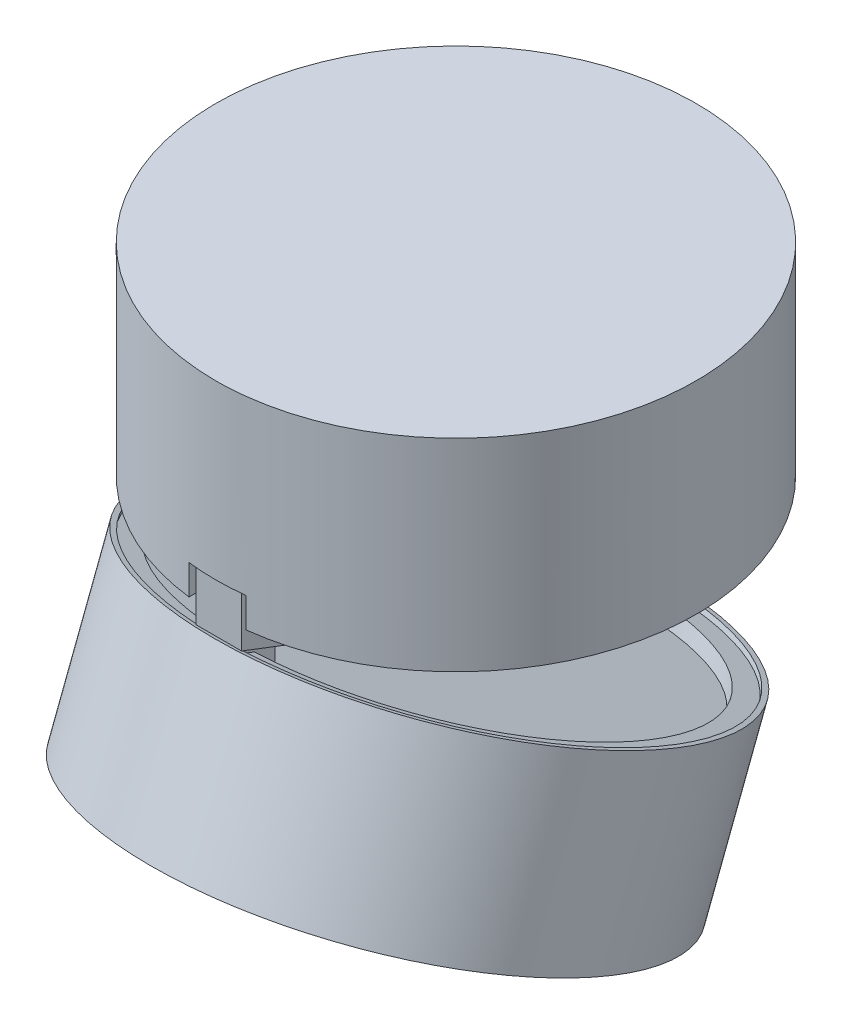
ISO-10303-21;
HEADER;
FILE_DESCRIPTION(('STEP AP214'),'2;1');
FILE_NAME('part.step','',(''),(''),'','','');
FILE_SCHEMA(('AUTOMOTIVE_DESIGN { 1 0 10303 214 1 1 1 1 }'));
ENDSEC;
DATA;
#1=APPLICATION_CONTEXT('core data for automotive mechanical design processes');
#2=APPLICATION_PROTOCOL_DEFINITION('international standard','automotive_design',2000,#1);
#3=PRODUCT_CONTEXT('',#1,'mechanical');
#4=PRODUCT('Part','Part','',(#3));
#5=PRODUCT_RELATED_PRODUCT_CATEGORY('part','',(#4));
#6=PRODUCT_DEFINITION_FORMATION('','',#4);
#7=PRODUCT_DEFINITION_CONTEXT('part definition',#1,'design');
#8=PRODUCT_DEFINITION('design','',#6,#7);
#9=PRODUCT_DEFINITION_SHAPE('','',#8);
#10=(LENGTH_UNIT() NAMED_UNIT(*) SI_UNIT(.MILLI.,.METRE.));
#11=(NAMED_UNIT(*) PLANE_ANGLE_UNIT() SI_UNIT($,.RADIAN.));
#12=(NAMED_UNIT(*) SI_UNIT($,.STERADIAN.) SOLID_ANGLE_UNIT());
#13=UNCERTAINTY_MEASURE_WITH_UNIT(LENGTH_MEASURE(1.E-05),#10,'distance_accuracy_value','');
#14=(GEOMETRIC_REPRESENTATION_CONTEXT(3) GLOBAL_UNCERTAINTY_ASSIGNED_CONTEXT((#13)) GLOBAL_UNIT_ASSIGNED_CONTEXT((#10,
#11,#12)) REPRESENTATION_CONTEXT('',''));
#15=CARTESIAN_POINT('',(0.,0.,0.));
#16=DIRECTION('',(0.,0.,1.));
#17=DIRECTION('',(1.,0.,0.));
#18=AXIS2_PLACEMENT_3D('',#15,#16,#17);
#19=CARTESIAN_POINT('',(-5.62166871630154,5.90428751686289,68.));
#20=DIRECTION('',(0.,-1.,0.));
#21=DIRECTION('',(0.,0.,-1.));
#22=AXIS2_PLACEMENT_3D('',#19,#20,#21);
#23=PLANE('',#22);
#24=CARTESIAN_POINT('',(0.,5.90428751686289,0.));
#25=DIRECTION('',(0.,-1.,0.));
#26=DIRECTION('',(0.,0.,-1.));
#27=AXIS2_PLACEMENT_3D('',#24,#25,#26);
#28=CIRCLE('',#27,47.5);
#29=CARTESIAN_POINT('',(5.62166871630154,5.90428751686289,47.166162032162));
#30=VERTEX_POINT('',#29);
#31=CARTESIAN_POINT('',(-5.62166871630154,5.90428751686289,47.166162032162));
#32=VERTEX_POINT('',#31);
#33=EDGE_CURVE('E675',#30,#32,#28,.T.);
#34=ORIENTED_EDGE('',*,*,#33,.T.);
#35=DIRECTION('',(0.,0.,-1.));
#36=VECTOR('',#35,1.);
#37=CARTESIAN_POINT('',(-5.62166871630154,5.90428751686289,68.));
#38=LINE('',#37,#36);
#39=CARTESIAN_POINT('',(-5.62166871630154,5.90428751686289,38.));
#40=VERTEX_POINT('',#39);
#41=EDGE_CURVE('E642',#32,#40,#38,.T.);
#42=ORIENTED_EDGE('',*,*,#41,.T.);
#43=DIRECTION('',(-1.,0.,0.));
#44=VECTOR('',#43,1.);
#45=CARTESIAN_POINT('',(5.62166871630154,5.90428751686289,38.));
#46=LINE('',#45,#44);
#47=CARTESIAN_POINT('',(5.62166871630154,5.90428751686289,38.));
#48=VERTEX_POINT('',#47);
#49=EDGE_CURVE('E639',#48,#40,#46,.T.);
#50=ORIENTED_EDGE('',*,*,#49,.F.);
#51=DIRECTION('',(0.,0.,-1.));
#52=VECTOR('',#51,1.);
#53=CARTESIAN_POINT('',(5.62166871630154,5.90428751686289,68.));
#54=LINE('',#53,#52);
#55=EDGE_CURVE('E644',#30,#48,#54,.T.);
#56=ORIENTED_EDGE('',*,*,#55,.F.);
#57=EDGE_LOOP('',(#34,#42,#50,#56));
#58=FACE_BOUND('',#57,.T.);
#59=DIRECTION('',(-1.,0.,0.));
#60=VECTOR('',#59,1.);
#61=CARTESIAN_POINT('',(-4.49331772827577,5.90428751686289,46.8980466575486));
#62=LINE('',#61,#60);
#63=CARTESIAN_POINT('',(4.49331772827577,5.90428751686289,46.8980466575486));
#64=VERTEX_POINT('',#63);
#65=CARTESIAN_POINT('',(-4.49331772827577,5.90428751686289,46.8980466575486));
#66=VERTEX_POINT('',#65);
#67=EDGE_CURVE('E616',#64,#66,#62,.T.);
#68=ORIENTED_EDGE('',*,*,#67,.F.);
#69=DIRECTION('',(0.,0.,1.));
#70=VECTOR('',#69,1.);
#71=CARTESIAN_POINT('',(4.49331772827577,5.90428751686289,46.8980466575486));
#72=LINE('',#71,#70);
#73=CARTESIAN_POINT('',(4.49331772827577,5.90428751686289,38.2681153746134));
#74=VERTEX_POINT('',#73);
#75=EDGE_CURVE('E613',#74,#64,#72,.T.);
#76=ORIENTED_EDGE('',*,*,#75,.F.);
#77=DIRECTION('',(1.,0.,0.));
#78=VECTOR('',#77,1.);
#79=CARTESIAN_POINT('',(-4.49331772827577,5.90428751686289,38.2681153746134));
#80=LINE('',#79,#78);
#81=CARTESIAN_POINT('',(-4.49331772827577,5.90428751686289,38.2681153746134));
#82=VERTEX_POINT('',#81);
#83=EDGE_CURVE('E622',#82,#74,#80,.T.);
#84=ORIENTED_EDGE('',*,*,#83,.F.);
#85=DIRECTION('',(0.,0.,-1.));
#86=VECTOR('',#85,1.);
#87=CARTESIAN_POINT('',(-4.49331772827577,5.90428751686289,46.8980466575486));
#88=LINE('',#87,#86);
#89=EDGE_CURVE('E619',#66,#82,#88,.T.);
#90=ORIENTED_EDGE('',*,*,#89,.F.);
#91=EDGE_LOOP('',(#68,#76,#84,#90));
#92=FACE_BOUND('',#91,.T.);
#93=ADVANCED_FACE('F37',(#58,#92),#23,.T.);
#94=CARTESIAN_POINT('',(0.,40.,0.));
#95=DIRECTION('',(0.,-1.,0.));
#96=DIRECTION('',(0.,0.,-1.));
#97=AXIS2_PLACEMENT_3D('',#94,#95,#96);
#98=CYLINDRICAL_SURFACE('',#97,47.5);
#99=CARTESIAN_POINT('',(0.,40.,0.));
#100=DIRECTION('',(0.,1.,0.));
#101=DIRECTION('',(0.,0.,1.));
#102=AXIS2_PLACEMENT_3D('',#99,#100,#101);
#103=CIRCLE('',#102,47.5);
#104=CARTESIAN_POINT('',(0.,40.,47.5));
#105=VERTEX_POINT('',#104);
#106=EDGE_CURVE('E665',#105,#105,#103,.T.);
#107=ORIENTED_EDGE('',*,*,#106,.F.);
#108=EDGE_LOOP('',(#107));
#109=FACE_BOUND('',#108,.T.);
#110=DIRECTION('',(0.,-1.,0.));
#111=VECTOR('',#110,1.);
#112=CARTESIAN_POINT('',(5.62166871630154,40.,47.166162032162));
#113=LINE('',#112,#111);
#114=CARTESIAN_POINT('',(5.62166871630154,0.,47.166162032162));
#115=VERTEX_POINT('',#114);
#116=EDGE_CURVE('E656',#115,#30,#113,.F.);
#117=ORIENTED_EDGE('',*,*,#116,.F.);
#118=CARTESIAN_POINT('',(0.,0.,0.));
#119=DIRECTION('',(0.,1.,0.));
#120=DIRECTION('',(0.,0.,1.));
#121=AXIS2_PLACEMENT_3D('',#118,#119,#120);
#122=CIRCLE('',#121,47.5);
#123=CARTESIAN_POINT('',(-5.62166871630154,0.,47.166162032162));
#124=VERTEX_POINT('',#123);
#125=EDGE_CURVE('E662',#115,#124,#122,.T.);
#126=ORIENTED_EDGE('',*,*,#125,.T.);
#127=DIRECTION('',(0.,-1.,0.));
#128=VECTOR('',#127,1.);
#129=CARTESIAN_POINT('',(-5.62166871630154,40.,47.166162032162));
#130=LINE('',#129,#128);
#131=EDGE_CURVE('E650',#32,#124,#130,.T.);
#132=ORIENTED_EDGE('',*,*,#131,.F.);
#133=ORIENTED_EDGE('',*,*,#33,.F.);
#134=EDGE_LOOP('',(#117,#126,#132,#133));
#135=FACE_BOUND('',#134,.T.);
#136=ADVANCED_FACE('F39',(#109,#135),#98,.T.);
#137=CARTESIAN_POINT('',(0.,0.,0.));
#138=DIRECTION('',(0.,1.,0.));
#139=DIRECTION('',(0.,0.,1.));
#140=AXIS2_PLACEMENT_3D('',#137,#138,#139);
#141=PLANE('',#140);
#142=DIRECTION('',(0.,0.,1.));
#143=VECTOR('',#142,1.);
#144=CARTESIAN_POINT('',(5.62166871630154,0.,0.));
#145=LINE('',#144,#143);
#146=CARTESIAN_POINT('',(5.62166871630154,0.,44.6474729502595));
#147=VERTEX_POINT('',#146);
#148=EDGE_CURVE('E654',#147,#115,#145,.T.);
#149=ORIENTED_EDGE('',*,*,#148,.F.);
#150=CARTESIAN_POINT('',(0.,0.,0.));
#151=DIRECTION('',(0.,-1.,0.));
#152=DIRECTION('',(0.,0.,-1.));
#153=AXIS2_PLACEMENT_3D('',#150,#151,#152);
#154=CIRCLE('',#153,45.);
#155=CARTESIAN_POINT('',(-5.62166871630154,0.,44.6474729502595));
#156=VERTEX_POINT('',#155);
#157=EDGE_CURVE('E658',#156,#147,#154,.T.);
#158=ORIENTED_EDGE('',*,*,#157,.F.);
#159=DIRECTION('',(0.,0.,-1.));
#160=VECTOR('',#159,1.);
#161=CARTESIAN_POINT('',(-5.62166871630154,0.,0.));
#162=LINE('',#161,#160);
#163=EDGE_CURVE('E648',#124,#156,#162,.T.);
#164=ORIENTED_EDGE('',*,*,#163,.F.);
#165=ORIENTED_EDGE('',*,*,#125,.F.);
#166=EDGE_LOOP('',(#149,#158,#164,#165));
#167=FACE_BOUND('',#166,.T.);
#168=ADVANCED_FACE('F731',(#167),#141,.F.);
#169=CARTESIAN_POINT('',(0.,1.,0.));
#170=DIRECTION('',(0.,-1.,0.));
#171=DIRECTION('',(0.,0.,-1.));
#172=AXIS2_PLACEMENT_3D('',#169,#170,#171);
#173=CYLINDRICAL_SURFACE('',#172,45.);
#174=DIRECTION('',(0.,-1.,0.));
#175=VECTOR('',#174,1.);
#176=CARTESIAN_POINT('',(5.62166871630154,1.,44.6474729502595));
#177=LINE('',#176,#175);
#178=CARTESIAN_POINT('',(5.62166871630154,1.,44.6474729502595));
#179=VERTEX_POINT('',#178);
#180=EDGE_CURVE('E652',#179,#147,#177,.T.);
#181=ORIENTED_EDGE('',*,*,#180,.F.);
#182=CARTESIAN_POINT('',(0.,1.,0.));
#183=DIRECTION('',(0.,-1.,0.));
#184=DIRECTION('',(0.,0.,-1.));
#185=AXIS2_PLACEMENT_3D('',#182,#183,#184);
#186=CIRCLE('',#185,45.);
#187=CARTESIAN_POINT('',(-5.62166871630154,1.,44.6474729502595));
#188=VERTEX_POINT('',#187);
#189=EDGE_CURVE('E659',#188,#179,#186,.T.);
#190=ORIENTED_EDGE('',*,*,#189,.F.);
#191=DIRECTION('',(0.,-1.,0.));
#192=VECTOR('',#191,1.);
#193=CARTESIAN_POINT('',(-5.62166871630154,1.,44.6474729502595));
#194=LINE('',#193,#192);
#195=EDGE_CURVE('E646',#156,#188,#194,.F.);
#196=ORIENTED_EDGE('',*,*,#195,.F.);
#197=ORIENTED_EDGE('',*,*,#157,.T.);
#198=EDGE_LOOP('',(#181,#190,#196,#197));
#199=FACE_BOUND('',#198,.T.);
#200=ADVANCED_FACE('F745',(#199),#173,.F.);
#201=CARTESIAN_POINT('',(0.,1.,0.));
#202=DIRECTION('',(0.,-1.,0.));
#203=DIRECTION('',(0.,0.,-1.));
#204=AXIS2_PLACEMENT_3D('',#201,#202,#203);
#205=PLANE('',#204);
#206=DIRECTION('',(-1.,0.,0.));
#207=VECTOR('',#206,1.);
#208=CARTESIAN_POINT('',(0.,1.,38.));
#209=LINE('',#208,#207);
#210=CARTESIAN_POINT('',(5.62166871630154,1.,38.));
#211=VERTEX_POINT('',#210);
#212=CARTESIAN_POINT('',(-5.62166871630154,1.,38.));
#213=VERTEX_POINT('',#212);
#214=EDGE_CURVE('E677',#211,#213,#209,.T.);
#215=ORIENTED_EDGE('',*,*,#214,.T.);
#216=DIRECTION('',(0.,0.,1.));
#217=VECTOR('',#216,1.);
#218=CARTESIAN_POINT('',(-5.62166871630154,1.,0.));
#219=LINE('',#218,#217);
#220=EDGE_CURVE('E668',#213,#188,#219,.T.);
#221=ORIENTED_EDGE('',*,*,#220,.T.);
#222=ORIENTED_EDGE('',*,*,#189,.T.);
#223=DIRECTION('',(0.,0.,-1.));
#224=VECTOR('',#223,1.);
#225=CARTESIAN_POINT('',(5.62166871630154,1.,0.));
#226=LINE('',#225,#224);
#227=EDGE_CURVE('E673',#179,#211,#226,.T.);
#228=ORIENTED_EDGE('',*,*,#227,.T.);
#229=EDGE_LOOP('',(#215,#221,#222,#228));
#230=FACE_BOUND('',#229,.T.);
#231=ADVANCED_FACE('F742',(#230),#205,.T.);
#232=CARTESIAN_POINT('',(0.,40.,0.));
#233=DIRECTION('',(0.,1.,0.));
#234=DIRECTION('',(0.,0.,1.));
#235=AXIS2_PLACEMENT_3D('',#232,#233,#234);
#236=PLANE('',#235);
#237=ORIENTED_EDGE('',*,*,#106,.T.);
#238=EDGE_LOOP('',(#237));
#239=FACE_BOUND('',#238,.T.);
#240=ADVANCED_FACE('F740',(#239),#236,.T.);
#241=CARTESIAN_POINT('',(5.62166871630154,-5.90428751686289,68.));
#242=DIRECTION('',(-1.,0.,0.));
#243=DIRECTION('',(0.,0.,1.));
#244=AXIS2_PLACEMENT_3D('',#241,#242,#243);
#245=PLANE('',#244);
#246=ORIENTED_EDGE('',*,*,#116,.T.);
#247=ORIENTED_EDGE('',*,*,#55,.T.);
#248=DIRECTION('',(0.,1.,0.));
#249=VECTOR('',#248,1.);
#250=CARTESIAN_POINT('',(5.62166871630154,-5.90428751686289,38.));
#251=LINE('',#250,#249);
#252=EDGE_CURVE('E636',#211,#48,#251,.T.);
#253=ORIENTED_EDGE('',*,*,#252,.F.);
#254=ORIENTED_EDGE('',*,*,#227,.F.);
#255=ORIENTED_EDGE('',*,*,#180,.T.);
#256=ORIENTED_EDGE('',*,*,#148,.T.);
#257=EDGE_LOOP('',(#246,#247,#253,#254,#255,#256));
#258=FACE_BOUND('',#257,.T.);
#259=ADVANCED_FACE('F737',(#258),#245,.T.);
#260=CARTESIAN_POINT('',(-5.62166871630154,-5.90428751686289,68.));
#261=DIRECTION('',(1.,0.,0.));
#262=DIRECTION('',(0.,0.,-1.));
#263=AXIS2_PLACEMENT_3D('',#260,#261,#262);
#264=PLANE('',#263);
#265=ORIENTED_EDGE('',*,*,#131,.T.);
#266=ORIENTED_EDGE('',*,*,#163,.T.);
#267=ORIENTED_EDGE('',*,*,#195,.T.);
#268=ORIENTED_EDGE('',*,*,#220,.F.);
#269=DIRECTION('',(0.,-1.,0.));
#270=VECTOR('',#269,1.);
#271=CARTESIAN_POINT('',(-5.62166871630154,5.90428751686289,38.));
#272=LINE('',#271,#270);
#273=EDGE_CURVE('E633',#40,#213,#272,.T.);
#274=ORIENTED_EDGE('',*,*,#273,.F.);
#275=ORIENTED_EDGE('',*,*,#41,.F.);
#276=EDGE_LOOP('',(#265,#266,#267,#268,#274,#275));
#277=FACE_BOUND('',#276,.T.);
#278=ADVANCED_FACE('F735',(#277),#264,.T.);
#279=CARTESIAN_POINT('',(0.,0.,38.));
#280=DIRECTION('',(0.,0.,1.));
#281=DIRECTION('',(1.,0.,0.));
#282=AXIS2_PLACEMENT_3D('',#279,#280,#281);
#283=PLANE('',#282);
#284=ORIENTED_EDGE('',*,*,#252,.T.);
#285=ORIENTED_EDGE('',*,*,#49,.T.);
#286=ORIENTED_EDGE('',*,*,#273,.T.);
#287=ORIENTED_EDGE('',*,*,#214,.F.);
#288=EDGE_LOOP('',(#284,#285,#286,#287));
#289=FACE_BOUND('',#288,.T.);
#290=ADVANCED_FACE('F769',(#289),#283,.T.);
#291=CARTESIAN_POINT('',(4.49331772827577,-9.09571248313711,46.8980466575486));
#292=DIRECTION('',(-1.,0.,0.));
#293=DIRECTION('',(0.,0.,1.));
#294=AXIS2_PLACEMENT_3D('',#291,#292,#293);
#295=PLANE('',#294);
#296=DIRECTION('',(0.,1.,0.));
#297=VECTOR('',#296,1.);
#298=CARTESIAN_POINT('',(4.49331772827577,-9.09571248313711,46.8980466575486));
#299=LINE('',#298,#297);
#300=CARTESIAN_POINT('',(4.49331772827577,-4.32438757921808,46.8980466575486));
#301=VERTEX_POINT('',#300);
#302=EDGE_CURVE('E631',#301,#64,#299,.T.);
#303=ORIENTED_EDGE('',*,*,#302,.F.);
#304=DIRECTION('',(0.,-0.3583679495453,-0.933580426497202));
#305=VECTOR('',#304,1.);
#306=CARTESIAN_POINT('',(4.49331772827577,-4.93715732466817,45.3017268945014));
#307=LINE('',#306,#305);
#308=CARTESIAN_POINT('',(4.49331772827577,-4.41805322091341,46.6540393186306));
#309=VERTEX_POINT('',#308);
#310=EDGE_CURVE('E610',#301,#309,#307,.T.);
#311=ORIENTED_EDGE('',*,*,#310,.T.);
#312=CARTESIAN_POINT('',(4.49331772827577,-7.63710782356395,38.2681153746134));
#313=VERTEX_POINT('',#312);
#314=EDGE_CURVE('E609',#309,#313,#307,.T.);
#315=ORIENTED_EDGE('',*,*,#314,.T.);
#316=DIRECTION('',(0.,1.,0.));
#317=VECTOR('',#316,1.);
#318=CARTESIAN_POINT('',(4.49331772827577,-9.09571248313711,38.2681153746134));
#319=LINE('',#318,#317);
#320=EDGE_CURVE('E625',#313,#74,#319,.T.);
#321=ORIENTED_EDGE('',*,*,#320,.T.);
#322=ORIENTED_EDGE('',*,*,#75,.T.);
#323=EDGE_LOOP('',(#303,#311,#315,#321,#322));
#324=FACE_BOUND('',#323,.T.);
#325=ADVANCED_FACE('F696',(#324),#295,.F.);
#326=CARTESIAN_POINT('',(-4.49331772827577,-9.09571248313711,46.8980466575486));
#327=DIRECTION('',(0.,0.,-1.));
#328=DIRECTION('',(-1.,0.,0.));
#329=AXIS2_PLACEMENT_3D('',#326,#327,#328);
#330=PLANE('',#329);
#331=DIRECTION('',(0.,1.,0.));
#332=VECTOR('',#331,1.);
#333=CARTESIAN_POINT('',(-4.49331772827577,-9.09571248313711,46.8980466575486));
#334=LINE('',#333,#332);
#335=CARTESIAN_POINT('',(-4.49331772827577,-4.32438757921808,46.8980466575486));
#336=VERTEX_POINT('',#335);
#337=EDGE_CURVE('E629',#336,#66,#334,.T.);
#338=ORIENTED_EDGE('',*,*,#337,.F.);
#339=DIRECTION('',(1.,0.,0.));
#340=VECTOR('',#339,1.);
#341=CARTESIAN_POINT('',(-4.49331772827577,-4.32438757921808,46.8980466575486));
#342=LINE('',#341,#340);
#343=EDGE_CURVE('E606',#336,#301,#342,.T.);
#344=ORIENTED_EDGE('',*,*,#343,.T.);
#345=ORIENTED_EDGE('',*,*,#302,.T.);
#346=ORIENTED_EDGE('',*,*,#67,.T.);
#347=EDGE_LOOP('',(#338,#344,#345,#346));
#348=FACE_BOUND('',#347,.T.);
#349=ADVANCED_FACE('F781',(#348),#330,.F.);
#350=CARTESIAN_POINT('',(-4.49331772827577,-9.09571248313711,46.8980466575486));
#351=DIRECTION('',(1.,0.,0.));
#352=DIRECTION('',(0.,0.,-1.));
#353=AXIS2_PLACEMENT_3D('',#350,#351,#352);
#354=PLANE('',#353);
#355=DIRECTION('',(0.,1.,0.));
#356=VECTOR('',#355,1.);
#357=CARTESIAN_POINT('',(-4.49331772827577,-9.09571248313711,38.2681153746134));
#358=LINE('',#357,#356);
#359=CARTESIAN_POINT('',(-4.49331772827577,-7.63710782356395,38.2681153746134));
#360=VERTEX_POINT('',#359);
#361=EDGE_CURVE('E627',#360,#82,#358,.T.);
#362=ORIENTED_EDGE('',*,*,#361,.F.);
#363=DIRECTION('',(0.,0.3583679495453,0.933580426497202));
#364=VECTOR('',#363,1.);
#365=CARTESIAN_POINT('',(-4.49331772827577,-4.93715732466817,45.3017268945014));
#366=LINE('',#365,#364);
#367=CARTESIAN_POINT('',(-4.49331772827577,-4.4180532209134,46.6540393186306));
#368=VERTEX_POINT('',#367);
#369=EDGE_CURVE('E603',#360,#368,#366,.T.);
#370=ORIENTED_EDGE('',*,*,#369,.T.);
#371=EDGE_CURVE('E602',#368,#336,#366,.T.);
#372=ORIENTED_EDGE('',*,*,#371,.T.);
#373=ORIENTED_EDGE('',*,*,#337,.T.);
#374=ORIENTED_EDGE('',*,*,#89,.T.);
#375=EDGE_LOOP('',(#362,#370,#372,#373,#374));
#376=FACE_BOUND('',#375,.T.);
#377=ADVANCED_FACE('F687',(#376),#354,.F.);
#378=CARTESIAN_POINT('',(-4.49331772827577,-9.09571248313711,38.2681153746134));
#379=DIRECTION('',(0.,0.,1.));
#380=DIRECTION('',(1.,0.,0.));
#381=AXIS2_PLACEMENT_3D('',#378,#379,#380);
#382=PLANE('',#381);
#383=ORIENTED_EDGE('',*,*,#320,.F.);
#384=DIRECTION('',(-1.,0.,0.));
#385=VECTOR('',#384,1.);
#386=CARTESIAN_POINT('',(-4.49331772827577,-7.63710782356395,38.2681153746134));
#387=LINE('',#386,#385);
#388=EDGE_CURVE('E45',#313,#360,#387,.T.);
#389=ORIENTED_EDGE('',*,*,#388,.T.);
#390=ORIENTED_EDGE('',*,*,#361,.T.);
#391=ORIENTED_EDGE('',*,*,#83,.T.);
#392=EDGE_LOOP('',(#383,#389,#390,#391));
#393=FACE_BOUND('',#392,.T.);
#394=ADVANCED_FACE('F683',(#393),#382,.F.);
#395=CARTESIAN_POINT('',(0.,-3.9819463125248,47.7901366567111));
#396=DIRECTION('',(0.,0.933580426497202,-0.3583679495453));
#397=DIRECTION('',(0.,0.3583679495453,0.933580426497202));
#398=AXIS2_PLACEMENT_3D('',#395,#396,#397);
#399=PLANE('',#398);
#400=CARTESIAN_POINT('',(0.,-21.0564117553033,3.30963344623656));
#401=DIRECTION('',(0.,0.933580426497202,-0.3583679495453));
#402=DIRECTION('',(0.,0.3583679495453,0.933580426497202));
#403=AXIS2_PLACEMENT_3D('',#400,#401,#402);
#404=CIRCLE('',#403,46.6450683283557);
#405=EDGE_CURVE('E407',#309,#368,#404,.T.);
#406=ORIENTED_EDGE('',*,*,#405,.F.);
#407=ORIENTED_EDGE('',*,*,#310,.F.);
#408=ORIENTED_EDGE('',*,*,#343,.F.);
#409=ORIENTED_EDGE('',*,*,#371,.F.);
#410=EDGE_LOOP('',(#406,#407,#408,#409));
#411=FACE_BOUND('',#410,.T.);
#412=CARTESIAN_POINT('',(0.,-21.0564117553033,3.30963344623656));
#413=DIRECTION('',(0.,0.933580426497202,-0.3583679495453));
#414=DIRECTION('',(0.,0.3583679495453,0.933580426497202));
#415=AXIS2_PLACEMENT_3D('',#412,#413,#414);
#416=CIRCLE('',#415,47.6450683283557);
#417=CARTESIAN_POINT('',(0.,-3.9819463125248,47.7901366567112));
#418=VERTEX_POINT('',#417);
#419=EDGE_CURVE('E596',#418,#418,#416,.T.);
#420=ORIENTED_EDGE('',*,*,#419,.T.);
#421=EDGE_LOOP('',(#420));
#422=FACE_BOUND('',#421,.T.);
#423=ADVANCED_FACE('F701',(#411,#422),#399,.T.);
#424=CARTESIAN_POINT('',(0.,-21.0564117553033,3.30963344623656));
#425=DIRECTION('',(0.,0.933580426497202,-0.3583679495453));
#426=DIRECTION('',(0.,0.3583679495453,0.933580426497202));
#427=AXIS2_PLACEMENT_3D('',#424,#425,#426);
#428=CYLINDRICAL_SURFACE('',#427,47.6450683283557);
#429=CARTESIAN_POINT('',(0.,-53.7317266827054,15.8525116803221));
#430=DIRECTION('',(0.,0.933580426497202,-0.3583679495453));
#431=DIRECTION('',(0.,0.3583679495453,0.933580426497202));
#432=AXIS2_PLACEMENT_3D('',#429,#430,#431);
#433=CIRCLE('',#432,47.6450683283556);
#434=CARTESIAN_POINT('',(0.,-36.6572612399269,60.3330148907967));
#435=VERTEX_POINT('',#434);
#436=EDGE_CURVE('E599',#435,#435,#433,.T.);
#437=ORIENTED_EDGE('',*,*,#436,.T.);
#438=EDGE_LOOP('',(#437));
#439=FACE_BOUND('',#438,.T.);
#440=ORIENTED_EDGE('',*,*,#419,.F.);
#441=EDGE_LOOP('',(#440));
#442=FACE_BOUND('',#441,.T.);
#443=ADVANCED_FACE('F791',(#439,#442),#428,.T.);
#444=CARTESIAN_POINT('',(0.,-36.6572612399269,60.3330148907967));
#445=DIRECTION('',(0.,-0.933580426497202,0.3583679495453));
#446=DIRECTION('',(0.,-0.3583679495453,-0.933580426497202));
#447=AXIS2_PLACEMENT_3D('',#444,#445,#446);
#448=PLANE('',#447);
#449=CARTESIAN_POINT('',(0.,-53.7317266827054,15.8525116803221));
#450=DIRECTION('',(0.,-0.933580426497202,0.3583679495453));
#451=DIRECTION('',(0.,-0.3583679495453,-0.933580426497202));
#452=AXIS2_PLACEMENT_3D('',#449,#450,#451);
#453=CIRCLE('',#452,45.6450683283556);
#454=CARTESIAN_POINT('',(0.,-70.0894562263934,-26.7608306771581));
#455=VERTEX_POINT('',#454);
#456=EDGE_CURVE('E592',#455,#455,#453,.F.);
#457=ORIENTED_EDGE('',*,*,#456,.T.);
#458=EDGE_LOOP('',(#457));
#459=FACE_BOUND('',#458,.T.);
#460=ORIENTED_EDGE('',*,*,#436,.F.);
#461=EDGE_LOOP('',(#460));
#462=FACE_BOUND('',#461,.T.);
#463=ADVANCED_FACE('F794',(#459,#462),#448,.T.);
#464=CARTESIAN_POINT('',(-5.62166871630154,7.90428751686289,68.));
#465=DIRECTION('',(0.,-1.,0.));
#466=DIRECTION('',(0.,0.,-1.));
#467=AXIS2_PLACEMENT_3D('',#464,#465,#466);
#468=PLANE('',#467);
#469=CARTESIAN_POINT('',(0.,7.9042875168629,0.));
#470=DIRECTION('',(0.,-1.,0.));
#471=DIRECTION('',(0.,0.,-1.));
#472=AXIS2_PLACEMENT_3D('',#469,#470,#471);
#473=CIRCLE('',#472,45.5);
#474=CARTESIAN_POINT('',(7.62166871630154,7.90428751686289,44.8571083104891));
#475=VERTEX_POINT('',#474);
#476=CARTESIAN_POINT('',(-7.62166871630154,7.90428751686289,44.8571083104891));
#477=VERTEX_POINT('',#476);
#478=EDGE_CURVE('E525',#475,#477,#473,.T.);
#479=ORIENTED_EDGE('',*,*,#478,.F.);
#480=DIRECTION('',(0.,0.,-1.));
#481=VECTOR('',#480,1.);
#482=CARTESIAN_POINT('',(7.62166871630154,7.90428751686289,68.));
#483=LINE('',#482,#481);
#484=CARTESIAN_POINT('',(7.62166871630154,7.90428751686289,36.));
#485=VERTEX_POINT('',#484);
#486=EDGE_CURVE('E531',#475,#485,#483,.T.);
#487=ORIENTED_EDGE('',*,*,#486,.T.);
#488=DIRECTION('',(-1.,0.,0.));
#489=VECTOR('',#488,1.);
#490=CARTESIAN_POINT('',(-5.62166871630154,7.90428751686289,36.));
#491=LINE('',#490,#489);
#492=CARTESIAN_POINT('',(-7.62166871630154,7.90428751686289,36.));
#493=VERTEX_POINT('',#492);
#494=EDGE_CURVE('E532',#485,#493,#491,.T.);
#495=ORIENTED_EDGE('',*,*,#494,.T.);
#496=DIRECTION('',(0.,0.,-1.));
#497=VECTOR('',#496,1.);
#498=CARTESIAN_POINT('',(-7.62166871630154,7.90428751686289,68.));
#499=LINE('',#498,#497);
#500=EDGE_CURVE('E529',#477,#493,#499,.T.);
#501=ORIENTED_EDGE('',*,*,#500,.F.);
#502=EDGE_LOOP('',(#479,#487,#495,#501));
#503=FACE_BOUND('',#502,.T.);
#504=DIRECTION('',(-1.,0.,0.));
#505=VECTOR('',#504,1.);
#506=CARTESIAN_POINT('',(-4.49331772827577,7.9042875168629,44.8980466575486));
#507=LINE('',#506,#505);
#508=CARTESIAN_POINT('',(2.49331772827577,7.90428751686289,44.8980466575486));
#509=VERTEX_POINT('',#508);
#510=CARTESIAN_POINT('',(-2.49331772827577,7.90428751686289,44.8980466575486));
#511=VERTEX_POINT('',#510);
#512=EDGE_CURVE('E538',#509,#511,#507,.T.);
#513=ORIENTED_EDGE('',*,*,#512,.T.);
#514=DIRECTION('',(0.,0.,-1.));
#515=VECTOR('',#514,1.);
#516=CARTESIAN_POINT('',(-2.49331772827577,7.9042875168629,46.8980466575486));
#517=LINE('',#516,#515);
#518=CARTESIAN_POINT('',(-2.49331772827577,7.90428751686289,40.2681153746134));
#519=VERTEX_POINT('',#518);
#520=EDGE_CURVE('E541',#511,#519,#517,.T.);
#521=ORIENTED_EDGE('',*,*,#520,.T.);
#522=DIRECTION('',(1.,0.,0.));
#523=VECTOR('',#522,1.);
#524=CARTESIAN_POINT('',(-4.49331772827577,7.9042875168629,40.2681153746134));
#525=LINE('',#524,#523);
#526=CARTESIAN_POINT('',(2.49331772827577,7.90428751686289,40.2681153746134));
#527=VERTEX_POINT('',#526);
#528=EDGE_CURVE('E546',#519,#527,#525,.T.);
#529=ORIENTED_EDGE('',*,*,#528,.T.);
#530=DIRECTION('',(0.,0.,1.));
#531=VECTOR('',#530,1.);
#532=CARTESIAN_POINT('',(2.49331772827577,7.9042875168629,46.8980466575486));
#533=LINE('',#532,#531);
#534=EDGE_CURVE('E542',#527,#509,#533,.T.);
#535=ORIENTED_EDGE('',*,*,#534,.T.);
#536=EDGE_LOOP('',(#513,#521,#529,#535));
#537=FACE_BOUND('',#536,.T.);
#538=ADVANCED_FACE('F798',(#503,#537),#468,.F.);
#539=CARTESIAN_POINT('',(0.,40.,0.));
#540=DIRECTION('',(0.,-1.,0.));
#541=DIRECTION('',(0.,0.,-1.));
#542=AXIS2_PLACEMENT_3D('',#539,#540,#541);
#543=CYLINDRICAL_SURFACE('',#542,45.5);
#544=CARTESIAN_POINT('',(0.,38.,0.));
#545=DIRECTION('',(0.,1.,0.));
#546=DIRECTION('',(0.,0.,1.));
#547=AXIS2_PLACEMENT_3D('',#544,#545,#546);
#548=CIRCLE('',#547,45.5);
#549=CARTESIAN_POINT('',(0.,38.,45.5));
#550=VERTEX_POINT('',#549);
#551=EDGE_CURVE('E552',#550,#550,#548,.T.);
#552=ORIENTED_EDGE('',*,*,#551,.T.);
#553=EDGE_LOOP('',(#552));
#554=FACE_BOUND('',#553,.T.);
#555=DIRECTION('',(0.,-1.,0.));
#556=VECTOR('',#555,1.);
#557=CARTESIAN_POINT('',(7.62166871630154,2.,44.8571083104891));
#558=LINE('',#557,#556);
#559=CARTESIAN_POINT('',(7.62166871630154,3.,44.8571083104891));
#560=VERTEX_POINT('',#559);
#561=EDGE_CURVE('E556',#560,#475,#558,.F.);
#562=ORIENTED_EDGE('',*,*,#561,.T.);
#563=ORIENTED_EDGE('',*,*,#478,.T.);
#564=DIRECTION('',(0.,-1.,0.));
#565=VECTOR('',#564,1.);
#566=CARTESIAN_POINT('',(-7.62166871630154,7.90428751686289,44.8571083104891));
#567=LINE('',#566,#565);
#568=CARTESIAN_POINT('',(-7.62166871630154,3.,44.8571083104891));
#569=VERTEX_POINT('',#568);
#570=EDGE_CURVE('E537',#477,#569,#567,.T.);
#571=ORIENTED_EDGE('',*,*,#570,.T.);
#572=CARTESIAN_POINT('',(0.,3.,0.));
#573=DIRECTION('',(0.,-1.,0.));
#574=DIRECTION('',(0.,0.,-1.));
#575=AXIS2_PLACEMENT_3D('',#572,#573,#574);
#576=CIRCLE('',#575,45.5);
#577=EDGE_CURVE('E589',#560,#569,#576,.F.);
#578=ORIENTED_EDGE('',*,*,#577,.F.);
#579=EDGE_LOOP('',(#562,#563,#571,#578));
#580=FACE_BOUND('',#579,.T.);
#581=ADVANCED_FACE('F846',(#554,#580),#543,.F.);
#582=CARTESIAN_POINT('',(0.,3.,0.));
#583=DIRECTION('',(0.,-1.,0.));
#584=DIRECTION('',(0.,0.,-1.));
#585=AXIS2_PLACEMENT_3D('',#582,#583,#584);
#586=PLANE('',#585);
#587=ORIENTED_EDGE('',*,*,#577,.T.);
#588=DIRECTION('',(0.,0.,1.));
#589=VECTOR('',#588,1.);
#590=CARTESIAN_POINT('',(-7.62166871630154,3.,0.));
#591=LINE('',#590,#589);
#592=CARTESIAN_POINT('',(-7.62166871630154,3.,36.));
#593=VERTEX_POINT('',#592);
#594=EDGE_CURVE('E555',#593,#569,#591,.T.);
#595=ORIENTED_EDGE('',*,*,#594,.F.);
#596=DIRECTION('',(-1.,0.,0.));
#597=VECTOR('',#596,1.);
#598=CARTESIAN_POINT('',(0.,3.,36.));
#599=LINE('',#598,#597);
#600=CARTESIAN_POINT('',(7.62166871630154,3.,36.));
#601=VERTEX_POINT('',#600);
#602=EDGE_CURVE('E527',#601,#593,#599,.T.);
#603=ORIENTED_EDGE('',*,*,#602,.F.);
#604=DIRECTION('',(0.,0.,-1.));
#605=VECTOR('',#604,1.);
#606=CARTESIAN_POINT('',(7.62166871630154,3.,0.));
#607=LINE('',#606,#605);
#608=EDGE_CURVE('E528',#560,#601,#607,.T.);
#609=ORIENTED_EDGE('',*,*,#608,.F.);
#610=EDGE_LOOP('',(#587,#595,#603,#609));
#611=FACE_BOUND('',#610,.T.);
#612=ADVANCED_FACE('F842',(#611),#586,.F.);
#613=CARTESIAN_POINT('',(0.,38.,0.));
#614=DIRECTION('',(0.,1.,0.));
#615=DIRECTION('',(0.,0.,1.));
#616=AXIS2_PLACEMENT_3D('',#613,#614,#615);
#617=PLANE('',#616);
#618=ORIENTED_EDGE('',*,*,#551,.F.);
#619=EDGE_LOOP('',(#618));
#620=FACE_BOUND('',#619,.T.);
#621=ADVANCED_FACE('F838',(#620),#617,.F.);
#622=CARTESIAN_POINT('',(7.62166871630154,-5.90428751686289,68.));
#623=DIRECTION('',(-1.,0.,0.));
#624=DIRECTION('',(0.,0.,1.));
#625=AXIS2_PLACEMENT_3D('',#622,#623,#624);
#626=PLANE('',#625);
#627=ORIENTED_EDGE('',*,*,#608,.T.);
#628=DIRECTION('',(0.,1.,0.));
#629=VECTOR('',#628,1.);
#630=CARTESIAN_POINT('',(7.62166871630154,-5.90428751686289,36.));
#631=LINE('',#630,#629);
#632=EDGE_CURVE('E535',#601,#485,#631,.T.);
#633=ORIENTED_EDGE('',*,*,#632,.T.);
#634=ORIENTED_EDGE('',*,*,#486,.F.);
#635=ORIENTED_EDGE('',*,*,#561,.F.);
#636=EDGE_LOOP('',(#627,#633,#634,#635));
#637=FACE_BOUND('',#636,.T.);
#638=ADVANCED_FACE('F834',(#637),#626,.F.);
#639=CARTESIAN_POINT('',(-7.62166871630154,-5.90428751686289,68.));
#640=DIRECTION('',(1.,0.,0.));
#641=DIRECTION('',(0.,0.,-1.));
#642=AXIS2_PLACEMENT_3D('',#639,#640,#641);
#643=PLANE('',#642);
#644=ORIENTED_EDGE('',*,*,#570,.F.);
#645=ORIENTED_EDGE('',*,*,#500,.T.);
#646=DIRECTION('',(0.,-1.,0.));
#647=VECTOR('',#646,1.);
#648=CARTESIAN_POINT('',(-7.62166871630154,-5.90428751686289,36.));
#649=LINE('',#648,#647);
#650=EDGE_CURVE('E568',#493,#593,#649,.T.);
#651=ORIENTED_EDGE('',*,*,#650,.T.);
#652=ORIENTED_EDGE('',*,*,#594,.T.);
#653=EDGE_LOOP('',(#644,#645,#651,#652));
#654=FACE_BOUND('',#653,.T.);
#655=ADVANCED_FACE('F830',(#654),#643,.F.);
#656=CARTESIAN_POINT('',(0.,0.,36.));
#657=DIRECTION('',(0.,0.,1.));
#658=DIRECTION('',(1.,0.,0.));
#659=AXIS2_PLACEMENT_3D('',#656,#657,#658);
#660=PLANE('',#659);
#661=ORIENTED_EDGE('',*,*,#632,.F.);
#662=ORIENTED_EDGE('',*,*,#602,.T.);
#663=ORIENTED_EDGE('',*,*,#650,.F.);
#664=ORIENTED_EDGE('',*,*,#494,.F.);
#665=EDGE_LOOP('',(#661,#662,#663,#664));
#666=FACE_BOUND('',#665,.T.);
#667=ADVANCED_FACE('F826',(#666),#660,.F.);
#668=CARTESIAN_POINT('',(2.49331772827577,-9.09571248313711,46.8980466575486));
#669=DIRECTION('',(-1.,0.,0.));
#670=DIRECTION('',(0.,0.,1.));
#671=AXIS2_PLACEMENT_3D('',#668,#669,#670);
#672=PLANE('',#671);
#673=DIRECTION('',(0.,1.,0.));
#674=VECTOR('',#673,1.);
#675=CARTESIAN_POINT('',(2.49331772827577,-9.09571248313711,44.8980466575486));
#676=LINE('',#675,#674);
#677=CARTESIAN_POINT('',(2.49331772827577,-7.23440563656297,44.8980466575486));
#678=VERTEX_POINT('',#677);
#679=EDGE_CURVE('E571',#678,#509,#676,.T.);
#680=ORIENTED_EDGE('',*,*,#679,.T.);
#681=ORIENTED_EDGE('',*,*,#534,.F.);
#682=DIRECTION('',(0.,1.,0.));
#683=VECTOR('',#682,1.);
#684=CARTESIAN_POINT('',(2.49331772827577,-9.09571248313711,40.2681153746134));
#685=LINE('',#684,#683);
#686=CARTESIAN_POINT('',(2.49331772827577,-9.01166974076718,40.2681153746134));
#687=VERTEX_POINT('',#686);
#688=EDGE_CURVE('E549',#687,#527,#685,.T.);
#689=ORIENTED_EDGE('',*,*,#688,.F.);
#690=DIRECTION('',(0.,-0.3583679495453,-0.933580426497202));
#691=VECTOR('',#690,1.);
#692=CARTESIAN_POINT('',(2.49331772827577,-6.80431817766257,46.018462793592));
#693=LINE('',#692,#691);
#694=CARTESIAN_POINT('',(2.49331772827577,-7.3081220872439,44.7060087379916));
#695=VERTEX_POINT('',#694);
#696=EDGE_CURVE('E575',#695,#687,#693,.T.);
#697=ORIENTED_EDGE('',*,*,#696,.F.);
#698=EDGE_CURVE('E545',#678,#695,#693,.T.);
#699=ORIENTED_EDGE('',*,*,#698,.F.);
#700=EDGE_LOOP('',(#680,#681,#689,#697,#699));
#701=FACE_BOUND('',#700,.T.);
#702=ADVANCED_FACE('F822',(#701),#672,.T.);
#703=CARTESIAN_POINT('',(-4.49331772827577,-9.09571248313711,44.8980466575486));
#704=DIRECTION('',(0.,0.,-1.));
#705=DIRECTION('',(-1.,0.,0.));
#706=AXIS2_PLACEMENT_3D('',#703,#704,#705);
#707=PLANE('',#706);
#708=DIRECTION('',(0.,1.,0.));
#709=VECTOR('',#708,1.);
#710=CARTESIAN_POINT('',(-2.49331772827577,-9.09571248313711,44.8980466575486));
#711=LINE('',#710,#709);
#712=CARTESIAN_POINT('',(-2.49331772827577,-7.23440563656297,44.8980466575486));
#713=VERTEX_POINT('',#712);
#714=EDGE_CURVE('E573',#713,#511,#711,.T.);
#715=ORIENTED_EDGE('',*,*,#714,.T.);
#716=ORIENTED_EDGE('',*,*,#512,.F.);
#717=ORIENTED_EDGE('',*,*,#679,.F.);
#718=DIRECTION('',(1.,0.,0.));
#719=VECTOR('',#718,1.);
#720=CARTESIAN_POINT('',(-4.49331772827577,-7.23440563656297,44.8980466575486));
#721=LINE('',#720,#719);
#722=EDGE_CURVE('E579',#713,#678,#721,.T.);
#723=ORIENTED_EDGE('',*,*,#722,.F.);
#724=EDGE_LOOP('',(#715,#716,#717,#723));
#725=FACE_BOUND('',#724,.T.);
#726=ADVANCED_FACE('F818',(#725),#707,.T.);
#727=CARTESIAN_POINT('',(-2.49331772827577,-9.09571248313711,46.8980466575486));
#728=DIRECTION('',(1.,0.,0.));
#729=DIRECTION('',(0.,0.,-1.));
#730=AXIS2_PLACEMENT_3D('',#727,#728,#729);
#731=PLANE('',#730);
#732=DIRECTION('',(0.,1.,0.));
#733=VECTOR('',#732,1.);
#734=CARTESIAN_POINT('',(-2.49331772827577,-9.09571248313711,40.2681153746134));
#735=LINE('',#734,#733);
#736=CARTESIAN_POINT('',(-2.49331772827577,-9.01166974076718,40.2681153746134));
#737=VERTEX_POINT('',#736);
#738=EDGE_CURVE('E577',#737,#519,#735,.T.);
#739=ORIENTED_EDGE('',*,*,#738,.T.);
#740=ORIENTED_EDGE('',*,*,#520,.F.);
#741=ORIENTED_EDGE('',*,*,#714,.F.);
#742=DIRECTION('',(0.,0.3583679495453,0.933580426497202));
#743=VECTOR('',#742,1.);
#744=CARTESIAN_POINT('',(-2.49331772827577,-6.80431817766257,46.018462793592));
#745=LINE('',#744,#743);
#746=CARTESIAN_POINT('',(-2.49331772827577,-7.30812208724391,44.7060087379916));
#747=VERTEX_POINT('',#746);
#748=EDGE_CURVE('E586',#747,#713,#745,.T.);
#749=ORIENTED_EDGE('',*,*,#748,.F.);
#750=EDGE_CURVE('E582',#737,#747,#745,.T.);
#751=ORIENTED_EDGE('',*,*,#750,.F.);
#752=EDGE_LOOP('',(#739,#740,#741,#749,#751));
#753=FACE_BOUND('',#752,.T.);
#754=ADVANCED_FACE('F814',(#753),#731,.T.);
#755=CARTESIAN_POINT('',(-4.49331772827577,-9.09571248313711,40.2681153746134));
#756=DIRECTION('',(0.,0.,1.));
#757=DIRECTION('',(1.,0.,0.));
#758=AXIS2_PLACEMENT_3D('',#755,#756,#757);
#759=PLANE('',#758);
#760=ORIENTED_EDGE('',*,*,#688,.T.);
#761=ORIENTED_EDGE('',*,*,#528,.F.);
#762=ORIENTED_EDGE('',*,*,#738,.F.);
#763=DIRECTION('',(-1.,0.,0.));
#764=VECTOR('',#763,1.);
#765=CARTESIAN_POINT('',(-4.49331772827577,-9.01166974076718,40.2681153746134));
#766=LINE('',#765,#764);
#767=EDGE_CURVE('E562',#687,#737,#766,.T.);
#768=ORIENTED_EDGE('',*,*,#767,.F.);
#769=EDGE_LOOP('',(#760,#761,#762,#768));
#770=FACE_BOUND('',#769,.T.);
#771=ADVANCED_FACE('F810',(#770),#759,.T.);
#772=CARTESIAN_POINT('',(0.,-5.8491071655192,48.5068725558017));
#773=DIRECTION('',(0.,0.933580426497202,-0.3583679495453));
#774=DIRECTION('',(0.,0.3583679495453,0.933580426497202));
#775=AXIS2_PLACEMENT_3D('',#772,#773,#774);
#776=PLANE('',#775);
#777=CARTESIAN_POINT('',(0.,-22.9235726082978,4.02636934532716));
#778=DIRECTION('',(0.,0.933580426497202,-0.3583679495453));
#779=DIRECTION('',(0.,0.3583679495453,0.933580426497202));
#780=AXIS2_PLACEMENT_3D('',#777,#778,#779);
#781=CIRCLE('',#780,43.6450683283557);
#782=EDGE_CURVE('E11',#747,#695,#781,.F.);
#783=ORIENTED_EDGE('',*,*,#782,.F.);
#784=ORIENTED_EDGE('',*,*,#748,.T.);
#785=ORIENTED_EDGE('',*,*,#722,.T.);
#786=ORIENTED_EDGE('',*,*,#698,.T.);
#787=EDGE_LOOP('',(#783,#784,#785,#786));
#788=FACE_BOUND('',#787,.T.);
#789=CARTESIAN_POINT('',(0.,-22.9235726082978,4.02636934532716));
#790=DIRECTION('',(0.,0.933580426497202,-0.3583679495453));
#791=DIRECTION('',(0.,0.3583679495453,0.933580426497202));
#792=AXIS2_PLACEMENT_3D('',#789,#790,#791);
#793=CIRCLE('',#792,45.6450683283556);
#794=CARTESIAN_POINT('',(0.,-6.5658430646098,46.6397117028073));
#795=VERTEX_POINT('',#794);
#796=EDGE_CURVE('E524',#795,#795,#793,.T.);
#797=ORIENTED_EDGE('',*,*,#796,.F.);
#798=EDGE_LOOP('',(#797));
#799=FACE_BOUND('',#798,.T.);
#800=ADVANCED_FACE('F806',(#788,#799),#776,.F.);
#801=CARTESIAN_POINT('',(0.,-21.0564117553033,3.30963344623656));
#802=DIRECTION('',(0.,0.933580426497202,-0.3583679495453));
#803=DIRECTION('',(0.,0.3583679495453,0.933580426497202));
#804=AXIS2_PLACEMENT_3D('',#801,#802,#803);
#805=CYLINDRICAL_SURFACE('',#804,45.6450683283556);
#806=ORIENTED_EDGE('',*,*,#456,.F.);
#807=EDGE_LOOP('',(#806));
#808=FACE_BOUND('',#807,.T.);
#809=ORIENTED_EDGE('',*,*,#796,.T.);
#810=EDGE_LOOP('',(#809));
#811=FACE_BOUND('',#810,.T.);
#812=ADVANCED_FACE('F802',(#808,#811),#805,.F.);
#813=CARTESIAN_POINT('',(0.,-53.7317266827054,15.8525116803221));
#814=DIRECTION('',(0.,0.933580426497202,-0.3583679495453));
#815=DIRECTION('',(0.,0.3583679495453,0.933580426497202));
#816=AXIS2_PLACEMENT_3D('',#813,#814,#815);
#817=CYLINDRICAL_SURFACE('',#816,43.6450683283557);
#818=CARTESIAN_POINT('',(0.,-53.7317266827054,15.8525116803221));
#819=DIRECTION('',(0.,-0.933580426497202,0.3583679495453));
#820=DIRECTION('',(0.,-0.3583679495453,-0.933580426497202));
#821=AXIS2_PLACEMENT_3D('',#818,#819,#820);
#822=CIRCLE('',#821,43.6450683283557);
#823=CARTESIAN_POINT('',(0.,-69.3727203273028,-24.8936698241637));
#824=VERTEX_POINT('',#823);
#825=EDGE_CURVE('E516',#824,#824,#822,.T.);
#826=ORIENTED_EDGE('',*,*,#825,.F.);
#827=EDGE_LOOP('',(#826));
#828=FACE_BOUND('',#827,.T.);
#829=CARTESIAN_POINT('',(0.,-22.9235726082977,4.02636934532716));
#830=DIRECTION('',(0.,-0.933580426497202,0.3583679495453));
#831=DIRECTION('',(0.,-0.3583679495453,-0.933580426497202));
#832=AXIS2_PLACEMENT_3D('',#829,#830,#831);
#833=CIRCLE('',#832,43.6450683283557);
#834=EDGE_CURVE('E521',#695,#747,#833,.T.);
#835=ORIENTED_EDGE('',*,*,#834,.T.);
#836=ORIENTED_EDGE('',*,*,#782,.T.);
#837=EDGE_LOOP('',(#835,#836));
#838=FACE_BOUND('',#837,.T.);
#839=ADVANCED_FACE('F805',(#828,#838),#817,.T.);
#840=CARTESIAN_POINT('',(0.,-22.9235726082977,4.02636934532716));
#841=DIRECTION('',(0.,-0.933580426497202,0.3583679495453));
#842=DIRECTION('',(0.,-0.3583679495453,-0.933580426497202));
#843=AXIS2_PLACEMENT_3D('',#840,#841,#842);
#844=PLANE('',#843);
#845=ORIENTED_EDGE('',*,*,#696,.T.);
#846=ORIENTED_EDGE('',*,*,#767,.T.);
#847=ORIENTED_EDGE('',*,*,#750,.T.);
#848=ORIENTED_EDGE('',*,*,#834,.F.);
#849=EDGE_LOOP('',(#845,#846,#847,#848));
#850=FACE_BOUND('',#849,.T.);
#851=ADVANCED_FACE('F856',(#850),#844,.F.);
#852=CARTESIAN_POINT('',(0.,-53.7317266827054,15.8525116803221));
#853=DIRECTION('',(0.,-0.933580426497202,0.3583679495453));
#854=DIRECTION('',(0.,-0.3583679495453,-0.933580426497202));
#855=AXIS2_PLACEMENT_3D('',#852,#853,#854);
#856=CONICAL_SURFACE('',#855,43.6450683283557,0.942477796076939);
#857=CARTESIAN_POINT('',(0.,-47.196663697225,13.343936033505));
#858=DIRECTION('',(0.,-0.933580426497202,0.3583679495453));
#859=DIRECTION('',(0.,-0.3583679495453,-0.933580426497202));
#860=AXIS2_PLACEMENT_3D('',#857,#858,#859);
#861=CIRCLE('',#860,34.0103948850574);
#862=CARTESIAN_POINT('',(0.,-59.384899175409,-18.4075029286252));
#863=VERTEX_POINT('',#862);
#864=EDGE_CURVE('E510',#863,#863,#861,.T.);
#865=ORIENTED_EDGE('',*,*,#864,.F.);
#866=EDGE_LOOP('',(#865));
#867=FACE_BOUND('',#866,.T.);
#868=ORIENTED_EDGE('',*,*,#825,.T.);
#869=EDGE_LOOP('',(#868));
#870=FACE_BOUND('',#869,.T.);
#871=ADVANCED_FACE('F860',(#867,#870),#856,.F.);
#872=CARTESIAN_POINT('',(0.,-45.3295028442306,12.6272001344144));
#873=DIRECTION('',(0.,-0.933580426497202,0.3583679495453));
#874=DIRECTION('',(0.,-0.3583679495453,-0.933580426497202));
#875=AXIS2_PLACEMENT_3D('',#872,#873,#874);
#876=CYLINDRICAL_SURFACE('',#875,34.0103948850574);
#877=CARTESIAN_POINT('',(0.,-45.3295028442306,12.6272001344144));
#878=DIRECTION('',(0.,-0.933580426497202,0.3583679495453));
#879=DIRECTION('',(0.,-0.3583679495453,-0.933580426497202));
#880=AXIS2_PLACEMENT_3D('',#877,#878,#879);
#881=CIRCLE('',#880,34.0103948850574);
#882=CARTESIAN_POINT('',(0.,-57.5177383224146,-19.1242388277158));
#883=VERTEX_POINT('',#882);
#884=EDGE_CURVE('E513',#883,#883,#881,.T.);
#885=ORIENTED_EDGE('',*,*,#884,.F.);
#886=EDGE_LOOP('',(#885));
#887=FACE_BOUND('',#886,.T.);
#888=ORIENTED_EDGE('',*,*,#864,.T.);
#889=EDGE_LOOP('',(#888));
#890=FACE_BOUND('',#889,.T.);
#891=ADVANCED_FACE('F864',(#887,#890),#876,.F.);
#892=CARTESIAN_POINT('',(0.,-45.3295028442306,12.6272001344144));
#893=DIRECTION('',(0.,-0.933580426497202,0.3583679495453));
#894=DIRECTION('',(0.,-0.3583679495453,-0.933580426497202));
#895=AXIS2_PLACEMENT_3D('',#892,#893,#894);
#896=PLANE('',#895);
#897=CARTESIAN_POINT('',(0.,-45.3295028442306,12.6272001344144));
#898=DIRECTION('',(0.,-0.933580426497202,0.3583679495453));
#899=DIRECTION('',(0.,-0.3583679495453,-0.933580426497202));
#900=AXIS2_PLACEMENT_3D('',#897,#898,#899);
#901=CIRCLE('',#900,33.0103948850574);
#902=CARTESIAN_POINT('',(0.,-57.1593703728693,-18.1906584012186));
#903=VERTEX_POINT('',#902);
#904=EDGE_CURVE('E507',#903,#903,#901,.T.);
#905=ORIENTED_EDGE('',*,*,#904,.F.);
#906=EDGE_LOOP('',(#905));
#907=FACE_BOUND('',#906,.T.);
#908=ORIENTED_EDGE('',*,*,#884,.T.);
#909=EDGE_LOOP('',(#908));
#910=FACE_BOUND('',#909,.T.);
#911=ADVANCED_FACE('F873',(#907,#910),#896,.T.);
#912=CARTESIAN_POINT('',(0.,-45.3295028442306,12.6272001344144));
#913=DIRECTION('',(0.,-0.933580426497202,0.3583679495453));
#914=DIRECTION('',(0.,-0.3583679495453,-0.933580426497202));
#915=AXIS2_PLACEMENT_3D('',#912,#913,#914);
#916=CYLINDRICAL_SURFACE('',#915,33.0103948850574);
#917=ORIENTED_EDGE('',*,*,#904,.T.);
#918=EDGE_LOOP('',(#917));
#919=FACE_BOUND('',#918,.T.);
#920=CARTESIAN_POINT('',(0.,-47.196663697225,13.343936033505));
#921=DIRECTION('',(0.,-0.933580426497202,0.3583679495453));
#922=DIRECTION('',(0.,-0.3583679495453,-0.933580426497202));
#923=AXIS2_PLACEMENT_3D('',#920,#921,#922);
#924=CIRCLE('',#923,33.0103948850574);
#925=CARTESIAN_POINT('',(0.,-59.0265312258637,-17.473922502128));
#926=VERTEX_POINT('',#925);
#927=EDGE_CURVE('E505',#926,#926,#924,.T.);
#928=ORIENTED_EDGE('',*,*,#927,.F.);
#929=EDGE_LOOP('',(#928));
#930=FACE_BOUND('',#929,.T.);
#931=ADVANCED_FACE('F869',(#919,#930),#916,.T.);
#932=CARTESIAN_POINT('',(0.,-47.196663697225,13.343936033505));
#933=DIRECTION('',(0.,-0.933580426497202,0.3583679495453));
#934=DIRECTION('',(0.,-0.3583679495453,-0.933580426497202));
#935=AXIS2_PLACEMENT_3D('',#932,#933,#934);
#936=PLANE('',#935);
#937=ORIENTED_EDGE('',*,*,#927,.T.);
#938=EDGE_LOOP('',(#937));
#939=FACE_BOUND('',#938,.T.);
#940=ADVANCED_FACE('F866',(#939),#936,.T.);
#941=CARTESIAN_POINT('',(0.,-3.9819463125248,47.7901366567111));
#942=DIRECTION('',(0.,0.933580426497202,-0.3583679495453));
#943=DIRECTION('',(0.,0.3583679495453,0.933580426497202));
#944=AXIS2_PLACEMENT_3D('',#941,#942,#943);
#945=PLANE('',#944);
#946=DIRECTION('',(0.,-0.3583679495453,-0.933580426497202));
#947=VECTOR('',#946,1.);
#948=CARTESIAN_POINT('',(3.49331772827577,-4.93715732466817,45.3017268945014));
#949=LINE('',#948,#947);
#950=CARTESIAN_POINT('',(3.49331772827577,-4.7082516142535,45.8980466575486));
#951=VERTEX_POINT('',#950);
#952=CARTESIAN_POINT('',(3.49331772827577,-7.25324378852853,39.2681153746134));
#953=VERTEX_POINT('',#952);
#954=EDGE_CURVE('E350',#951,#953,#949,.T.);
#955=ORIENTED_EDGE('',*,*,#954,.T.);
#956=DIRECTION('',(-1.,0.,0.));
#957=VECTOR('',#956,1.);
#958=CARTESIAN_POINT('',(-4.49331772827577,-7.25324378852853,39.2681153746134));
#959=LINE('',#958,#957);
#960=CARTESIAN_POINT('',(-3.49331772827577,-7.25324378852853,39.2681153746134));
#961=VERTEX_POINT('',#960);
#962=EDGE_CURVE('E383',#953,#961,#959,.T.);
#963=ORIENTED_EDGE('',*,*,#962,.T.);
#964=DIRECTION('',(0.,0.3583679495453,0.933580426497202));
#965=VECTOR('',#964,1.);
#966=CARTESIAN_POINT('',(-3.49331772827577,-4.93715732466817,45.3017268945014));
#967=LINE('',#966,#965);
#968=CARTESIAN_POINT('',(-3.49331772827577,-4.7082516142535,45.8980466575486));
#969=VERTEX_POINT('',#968);
#970=EDGE_CURVE('E404',#961,#969,#967,.T.);
#971=ORIENTED_EDGE('',*,*,#970,.T.);
#972=DIRECTION('',(1.,0.,0.));
#973=VECTOR('',#972,1.);
#974=CARTESIAN_POINT('',(-4.49331772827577,-4.7082516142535,45.8980466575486));
#975=LINE('',#974,#973);
#976=EDGE_CURVE('E401',#969,#951,#975,.T.);
#977=ORIENTED_EDGE('',*,*,#976,.T.);
#978=EDGE_LOOP('',(#955,#963,#971,#977));
#979=FACE_BOUND('',#978,.T.);
#980=EDGE_CURVE('E59',#368,#309,#404,.T.);
#981=ORIENTED_EDGE('',*,*,#980,.F.);
#982=ORIENTED_EDGE('',*,*,#369,.F.);
#983=ORIENTED_EDGE('',*,*,#388,.F.);
#984=ORIENTED_EDGE('',*,*,#314,.F.);
#985=EDGE_LOOP('',(#981,#982,#983,#984));
#986=FACE_BOUND('',#985,.T.);
#987=ADVANCED_FACE('F698',(#979,#986),#945,.F.);
#988=CARTESIAN_POINT('',(0.,-21.0564117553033,3.30963344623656));
#989=DIRECTION('',(0.,0.933580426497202,-0.3583679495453));
#990=DIRECTION('',(0.,0.3583679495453,0.933580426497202));
#991=AXIS2_PLACEMENT_3D('',#988,#989,#990);
#992=CYLINDRICAL_SURFACE('',#991,46.6450683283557);
#993=ORIENTED_EDGE('',*,*,#405,.T.);
#994=ORIENTED_EDGE('',*,*,#980,.T.);
#995=EDGE_LOOP('',(#993,#994));
#996=FACE_BOUND('',#995,.T.);
#997=CARTESIAN_POINT('',(0.,-21.9899921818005,3.66800139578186));
#998=DIRECTION('',(0.,0.933580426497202,-0.3583679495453));
#999=DIRECTION('',(0.,0.3583679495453,0.933580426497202));
#1000=AXIS2_PLACEMENT_3D('',#997,#998,#999);
#1001=CIRCLE('',#1000,46.6450683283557);
#1002=CARTESIAN_POINT('',(0.,-5.2738946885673,47.2149241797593));
#1003=VERTEX_POINT('',#1002);
#1004=EDGE_CURVE('E411',#1003,#1003,#1001,.T.);
#1005=ORIENTED_EDGE('',*,*,#1004,.F.);
#1006=EDGE_LOOP('',(#1005));
#1007=FACE_BOUND('',#1006,.T.);
#1008=ADVANCED_FACE('F704',(#996,#1007),#992,.F.);
#1009=CARTESIAN_POINT('',(-5.62166871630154,6.90428751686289,68.));
#1010=DIRECTION('',(0.,-1.,0.));
#1011=DIRECTION('',(0.,0.,-1.));
#1012=AXIS2_PLACEMENT_3D('',#1009,#1010,#1011);
#1013=PLANE('',#1012);
#1014=CARTESIAN_POINT('',(0.,6.90428751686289,0.));
#1015=DIRECTION('',(0.,-1.,0.));
#1016=DIRECTION('',(0.,0.,-1.));
#1017=AXIS2_PLACEMENT_3D('',#1014,#1015,#1016);
#1018=CIRCLE('',#1017,46.5);
#1019=CARTESIAN_POINT('',(6.62166871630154,6.90428751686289,46.0261176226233));
#1020=VERTEX_POINT('',#1019);
#1021=CARTESIAN_POINT('',(-6.62166871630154,6.90428751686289,46.0261176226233));
#1022=VERTEX_POINT('',#1021);
#1023=EDGE_CURVE('E330',#1020,#1022,#1018,.T.);
#1024=ORIENTED_EDGE('',*,*,#1023,.F.);
#1025=DIRECTION('',(0.,0.,-1.));
#1026=VECTOR('',#1025,1.);
#1027=CARTESIAN_POINT('',(6.62166871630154,6.90428751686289,68.));
#1028=LINE('',#1027,#1026);
#1029=CARTESIAN_POINT('',(6.62166871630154,6.90428751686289,37.));
#1030=VERTEX_POINT('',#1029);
#1031=EDGE_CURVE('E336',#1020,#1030,#1028,.T.);
#1032=ORIENTED_EDGE('',*,*,#1031,.T.);
#1033=DIRECTION('',(-1.,0.,0.));
#1034=VECTOR('',#1033,1.);
#1035=CARTESIAN_POINT('',(-5.62166871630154,6.90428751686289,37.));
#1036=LINE('',#1035,#1034);
#1037=CARTESIAN_POINT('',(-6.62166871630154,6.90428751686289,37.));
#1038=VERTEX_POINT('',#1037);
#1039=EDGE_CURVE('E337',#1030,#1038,#1036,.T.);
#1040=ORIENTED_EDGE('',*,*,#1039,.T.);
#1041=DIRECTION('',(0.,0.,-1.));
#1042=VECTOR('',#1041,1.);
#1043=CARTESIAN_POINT('',(-6.62166871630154,6.90428751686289,68.));
#1044=LINE('',#1043,#1042);
#1045=EDGE_CURVE('E334',#1022,#1038,#1044,.T.);
#1046=ORIENTED_EDGE('',*,*,#1045,.F.);
#1047=EDGE_LOOP('',(#1024,#1032,#1040,#1046));
#1048=FACE_BOUND('',#1047,.T.);
#1049=DIRECTION('',(-1.,0.,0.));
#1050=VECTOR('',#1049,1.);
#1051=CARTESIAN_POINT('',(-4.49331772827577,6.90428751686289,45.8980466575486));
#1052=LINE('',#1051,#1050);
#1053=CARTESIAN_POINT('',(3.49331772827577,6.90428751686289,45.8980466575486));
#1054=VERTEX_POINT('',#1053);
#1055=CARTESIAN_POINT('',(-3.49331772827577,6.90428751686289,45.8980466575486));
#1056=VERTEX_POINT('',#1055);
#1057=EDGE_CURVE('E343',#1054,#1056,#1052,.T.);
#1058=ORIENTED_EDGE('',*,*,#1057,.T.);
#1059=DIRECTION('',(0.,0.,-1.));
#1060=VECTOR('',#1059,1.);
#1061=CARTESIAN_POINT('',(-3.49331772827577,6.90428751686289,46.8980466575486));
#1062=LINE('',#1061,#1060);
#1063=CARTESIAN_POINT('',(-3.49331772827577,6.90428751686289,39.2681153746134));
#1064=VERTEX_POINT('',#1063);
#1065=EDGE_CURVE('E346',#1056,#1064,#1062,.T.);
#1066=ORIENTED_EDGE('',*,*,#1065,.T.);
#1067=DIRECTION('',(1.,0.,0.));
#1068=VECTOR('',#1067,1.);
#1069=CARTESIAN_POINT('',(-4.49331772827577,6.90428751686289,39.2681153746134));
#1070=LINE('',#1069,#1068);
#1071=CARTESIAN_POINT('',(3.49331772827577,6.90428751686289,39.2681153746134));
#1072=VERTEX_POINT('',#1071);
#1073=EDGE_CURVE('E351',#1064,#1072,#1070,.T.);
#1074=ORIENTED_EDGE('',*,*,#1073,.T.);
#1075=DIRECTION('',(0.,0.,1.));
#1076=VECTOR('',#1075,1.);
#1077=CARTESIAN_POINT('',(3.49331772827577,6.90428751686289,46.8980466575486));
#1078=LINE('',#1077,#1076);
#1079=EDGE_CURVE('E347',#1072,#1054,#1078,.T.);
#1080=ORIENTED_EDGE('',*,*,#1079,.T.);
#1081=EDGE_LOOP('',(#1058,#1066,#1074,#1080));
#1082=FACE_BOUND('',#1081,.T.);
#1083=ADVANCED_FACE('F707',(#1048,#1082),#1013,.F.);
#1084=CARTESIAN_POINT('',(0.,40.,0.));
#1085=DIRECTION('',(0.,-1.,0.));
#1086=DIRECTION('',(0.,0.,-1.));
#1087=AXIS2_PLACEMENT_3D('',#1084,#1085,#1086);
#1088=CYLINDRICAL_SURFACE('',#1087,46.5);
#1089=CARTESIAN_POINT('',(0.,39.,0.));
#1090=DIRECTION('',(0.,1.,0.));
#1091=DIRECTION('',(0.,0.,1.));
#1092=AXIS2_PLACEMENT_3D('',#1089,#1090,#1091);
#1093=CIRCLE('',#1092,46.5);
#1094=CARTESIAN_POINT('',(0.,39.,46.5));
#1095=VERTEX_POINT('',#1094);
#1096=EDGE_CURVE('E357',#1095,#1095,#1093,.T.);
#1097=ORIENTED_EDGE('',*,*,#1096,.T.);
#1098=EDGE_LOOP('',(#1097));
#1099=FACE_BOUND('',#1098,.T.);
#1100=DIRECTION('',(0.,-1.,0.));
#1101=VECTOR('',#1100,1.);
#1102=CARTESIAN_POINT('',(6.62166871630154,1.,46.0261176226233));
#1103=LINE('',#1102,#1101);
#1104=CARTESIAN_POINT('',(6.62166871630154,1.,46.0261176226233));
#1105=VERTEX_POINT('',#1104);
#1106=EDGE_CURVE('E362',#1105,#1020,#1103,.F.);
#1107=ORIENTED_EDGE('',*,*,#1106,.T.);
#1108=ORIENTED_EDGE('',*,*,#1023,.T.);
#1109=DIRECTION('',(0.,-1.,0.));
#1110=VECTOR('',#1109,1.);
#1111=CARTESIAN_POINT('',(-6.62166871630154,6.90428751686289,46.0261176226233));
#1112=LINE('',#1111,#1110);
#1113=CARTESIAN_POINT('',(-6.62166871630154,1.,46.0261176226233));
#1114=VERTEX_POINT('',#1113);
#1115=EDGE_CURVE('E369',#1022,#1114,#1112,.T.);
#1116=ORIENTED_EDGE('',*,*,#1115,.T.);
#1117=CARTESIAN_POINT('',(0.,1.,0.));
#1118=DIRECTION('',(0.,1.,0.));
#1119=DIRECTION('',(0.,0.,1.));
#1120=AXIS2_PLACEMENT_3D('',#1117,#1118,#1119);
#1121=CIRCLE('',#1120,46.5);
#1122=EDGE_CURVE('E361',#1105,#1114,#1121,.T.);
#1123=ORIENTED_EDGE('',*,*,#1122,.F.);
#1124=EDGE_LOOP('',(#1107,#1108,#1116,#1123));
#1125=FACE_BOUND('',#1124,.T.);
#1126=ADVANCED_FACE('F1004',(#1099,#1125),#1088,.F.);
#1127=CARTESIAN_POINT('',(0.,1.,0.));
#1128=DIRECTION('',(0.,1.,0.));
#1129=DIRECTION('',(0.,0.,1.));
#1130=AXIS2_PLACEMENT_3D('',#1127,#1128,#1129);
#1131=PLANE('',#1130);
#1132=DIRECTION('',(0.,0.,1.));
#1133=VECTOR('',#1132,1.);
#1134=CARTESIAN_POINT('',(6.62166871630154,1.,0.));
#1135=LINE('',#1134,#1133);
#1136=CARTESIAN_POINT('',(6.62166871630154,1.,45.5209128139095));
#1137=VERTEX_POINT('',#1136);
#1138=EDGE_CURVE('E365',#1137,#1105,#1135,.T.);
#1139=ORIENTED_EDGE('',*,*,#1138,.T.);
#1140=ORIENTED_EDGE('',*,*,#1122,.T.);
#1141=DIRECTION('',(0.,0.,-1.));
#1142=VECTOR('',#1141,1.);
#1143=CARTESIAN_POINT('',(-6.62166871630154,1.,0.));
#1144=LINE('',#1143,#1142);
#1145=CARTESIAN_POINT('',(-6.62166871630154,1.,45.5209128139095));
#1146=VERTEX_POINT('',#1145);
#1147=EDGE_CURVE('E372',#1114,#1146,#1144,.T.);
#1148=ORIENTED_EDGE('',*,*,#1147,.T.);
#1149=CARTESIAN_POINT('',(0.,1.,0.));
#1150=DIRECTION('',(0.,1.,0.));
#1151=DIRECTION('',(0.,0.,1.));
#1152=AXIS2_PLACEMENT_3D('',#1149,#1150,#1151);
#1153=CIRCLE('',#1152,46.);
#1154=EDGE_CURVE('E364',#1146,#1137,#1153,.F.);
#1155=ORIENTED_EDGE('',*,*,#1154,.T.);
#1156=EDGE_LOOP('',(#1139,#1140,#1148,#1155));
#1157=FACE_BOUND('',#1156,.T.);
#1158=ADVANCED_FACE('F1000',(#1157),#1131,.T.);
#1159=CARTESIAN_POINT('',(0.,1.,0.));
#1160=DIRECTION('',(0.,-1.,0.));
#1161=DIRECTION('',(0.,0.,-1.));
#1162=AXIS2_PLACEMENT_3D('',#1159,#1160,#1161);
#1163=CYLINDRICAL_SURFACE('',#1162,46.);
#1164=DIRECTION('',(0.,-1.,0.));
#1165=VECTOR('',#1164,1.);
#1166=CARTESIAN_POINT('',(6.62166871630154,2.,45.5209128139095));
#1167=LINE('',#1166,#1165);
#1168=CARTESIAN_POINT('',(6.62166871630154,2.,45.5209128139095));
#1169=VERTEX_POINT('',#1168);
#1170=EDGE_CURVE('E371',#1169,#1137,#1167,.T.);
#1171=ORIENTED_EDGE('',*,*,#1170,.T.);
#1172=ORIENTED_EDGE('',*,*,#1154,.F.);
#1173=DIRECTION('',(0.,-1.,0.));
#1174=VECTOR('',#1173,1.);
#1175=CARTESIAN_POINT('',(-6.62166871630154,1.,45.5209128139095));
#1176=LINE('',#1175,#1174);
#1177=CARTESIAN_POINT('',(-6.62166871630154,2.,45.5209128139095));
#1178=VERTEX_POINT('',#1177);
#1179=EDGE_CURVE('E342',#1146,#1178,#1176,.F.);
#1180=ORIENTED_EDGE('',*,*,#1179,.T.);
#1181=CARTESIAN_POINT('',(0.,2.,0.));
#1182=DIRECTION('',(0.,-1.,0.));
#1183=DIRECTION('',(0.,0.,-1.));
#1184=AXIS2_PLACEMENT_3D('',#1181,#1182,#1183);
#1185=CIRCLE('',#1184,46.);
#1186=EDGE_CURVE('E368',#1178,#1169,#1185,.T.);
#1187=ORIENTED_EDGE('',*,*,#1186,.T.);
#1188=EDGE_LOOP('',(#1171,#1172,#1180,#1187));
#1189=FACE_BOUND('',#1188,.T.);
#1190=ADVANCED_FACE('F996',(#1189),#1163,.T.);
#1191=CARTESIAN_POINT('',(0.,2.,0.));
#1192=DIRECTION('',(0.,-1.,0.));
#1193=DIRECTION('',(0.,0.,-1.));
#1194=AXIS2_PLACEMENT_3D('',#1191,#1192,#1193);
#1195=PLANE('',#1194);
#1196=DIRECTION('',(-1.,0.,0.));
#1197=VECTOR('',#1196,1.);
#1198=CARTESIAN_POINT('',(0.,2.,37.));
#1199=LINE('',#1198,#1197);
#1200=CARTESIAN_POINT('',(6.62166871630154,2.,37.));
#1201=VERTEX_POINT('',#1200);
#1202=CARTESIAN_POINT('',(-6.62166871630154,2.,37.));
#1203=VERTEX_POINT('',#1202);
#1204=EDGE_CURVE('E332',#1201,#1203,#1199,.T.);
#1205=ORIENTED_EDGE('',*,*,#1204,.F.);
#1206=DIRECTION('',(0.,0.,-1.));
#1207=VECTOR('',#1206,1.);
#1208=CARTESIAN_POINT('',(6.62166871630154,2.,0.));
#1209=LINE('',#1208,#1207);
#1210=EDGE_CURVE('E333',#1169,#1201,#1209,.T.);
#1211=ORIENTED_EDGE('',*,*,#1210,.F.);
#1212=ORIENTED_EDGE('',*,*,#1186,.F.);
#1213=DIRECTION('',(0.,0.,1.));
#1214=VECTOR('',#1213,1.);
#1215=CARTESIAN_POINT('',(-6.62166871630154,2.,0.));
#1216=LINE('',#1215,#1214);
#1217=EDGE_CURVE('E360',#1203,#1178,#1216,.T.);
#1218=ORIENTED_EDGE('',*,*,#1217,.F.);
#1219=EDGE_LOOP('',(#1205,#1211,#1212,#1218));
#1220=FACE_BOUND('',#1219,.T.);
#1221=ADVANCED_FACE('F992',(#1220),#1195,.F.);
#1222=CARTESIAN_POINT('',(0.,39.,0.));
#1223=DIRECTION('',(0.,1.,0.));
#1224=DIRECTION('',(0.,0.,1.));
#1225=AXIS2_PLACEMENT_3D('',#1222,#1223,#1224);
#1226=PLANE('',#1225);
#1227=ORIENTED_EDGE('',*,*,#1096,.F.);
#1228=EDGE_LOOP('',(#1227));
#1229=FACE_BOUND('',#1228,.T.);
#1230=ADVANCED_FACE('F988',(#1229),#1226,.F.);
#1231=CARTESIAN_POINT('',(6.62166871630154,-5.90428751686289,68.));
#1232=DIRECTION('',(-1.,0.,0.));
#1233=DIRECTION('',(0.,0.,1.));
#1234=AXIS2_PLACEMENT_3D('',#1231,#1232,#1233);
#1235=PLANE('',#1234);
#1236=ORIENTED_EDGE('',*,*,#1106,.F.);
#1237=ORIENTED_EDGE('',*,*,#1138,.F.);
#1238=ORIENTED_EDGE('',*,*,#1170,.F.);
#1239=ORIENTED_EDGE('',*,*,#1210,.T.);
#1240=DIRECTION('',(0.,1.,0.));
#1241=VECTOR('',#1240,1.);
#1242=CARTESIAN_POINT('',(6.62166871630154,-5.90428751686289,37.));
#1243=LINE('',#1242,#1241);
#1244=EDGE_CURVE('E340',#1201,#1030,#1243,.T.);
#1245=ORIENTED_EDGE('',*,*,#1244,.T.);
#1246=ORIENTED_EDGE('',*,*,#1031,.F.);
#1247=EDGE_LOOP('',(#1236,#1237,#1238,#1239,#1245,#1246));
#1248=FACE_BOUND('',#1247,.T.);
#1249=ADVANCED_FACE('F984',(#1248),#1235,.F.);
#1250=CARTESIAN_POINT('',(-6.62166871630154,-5.90428751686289,68.));
#1251=DIRECTION('',(1.,0.,0.));
#1252=DIRECTION('',(0.,0.,-1.));
#1253=AXIS2_PLACEMENT_3D('',#1250,#1251,#1252);
#1254=PLANE('',#1253);
#1255=ORIENTED_EDGE('',*,*,#1115,.F.);
#1256=ORIENTED_EDGE('',*,*,#1045,.T.);
#1257=DIRECTION('',(0.,-1.,0.));
#1258=VECTOR('',#1257,1.);
#1259=CARTESIAN_POINT('',(-6.62166871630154,-5.90428751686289,37.));
#1260=LINE('',#1259,#1258);
#1261=EDGE_CURVE('E389',#1038,#1203,#1260,.T.);
#1262=ORIENTED_EDGE('',*,*,#1261,.T.);
#1263=ORIENTED_EDGE('',*,*,#1217,.T.);
#1264=ORIENTED_EDGE('',*,*,#1179,.F.);
#1265=ORIENTED_EDGE('',*,*,#1147,.F.);
#1266=EDGE_LOOP('',(#1255,#1256,#1262,#1263,#1264,#1265));
#1267=FACE_BOUND('',#1266,.T.);
#1268=ADVANCED_FACE('F980',(#1267),#1254,.F.);
#1269=CARTESIAN_POINT('',(0.,0.,37.));
#1270=DIRECTION('',(0.,0.,1.));
#1271=DIRECTION('',(1.,0.,0.));
#1272=AXIS2_PLACEMENT_3D('',#1269,#1270,#1271);
#1273=PLANE('',#1272);
#1274=ORIENTED_EDGE('',*,*,#1244,.F.);
#1275=ORIENTED_EDGE('',*,*,#1204,.T.);
#1276=ORIENTED_EDGE('',*,*,#1261,.F.);
#1277=ORIENTED_EDGE('',*,*,#1039,.F.);
#1278=EDGE_LOOP('',(#1274,#1275,#1276,#1277));
#1279=FACE_BOUND('',#1278,.T.);
#1280=ADVANCED_FACE('F976',(#1279),#1273,.F.);
#1281=CARTESIAN_POINT('',(3.49331772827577,-9.09571248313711,46.8980466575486));
#1282=DIRECTION('',(-1.,0.,0.));
#1283=DIRECTION('',(0.,0.,1.));
#1284=AXIS2_PLACEMENT_3D('',#1281,#1282,#1283);
#1285=PLANE('',#1284);
#1286=DIRECTION('',(0.,1.,0.));
#1287=VECTOR('',#1286,1.);
#1288=CARTESIAN_POINT('',(3.49331772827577,-9.09571248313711,45.8980466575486));
#1289=LINE('',#1288,#1287);
#1290=EDGE_CURVE('E392',#951,#1054,#1289,.T.);
#1291=ORIENTED_EDGE('',*,*,#1290,.T.);
#1292=ORIENTED_EDGE('',*,*,#1079,.F.);
#1293=DIRECTION('',(0.,1.,0.));
#1294=VECTOR('',#1293,1.);
#1295=CARTESIAN_POINT('',(3.49331772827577,-9.09571248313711,39.2681153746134));
#1296=LINE('',#1295,#1294);
#1297=EDGE_CURVE('E354',#953,#1072,#1296,.T.);
#1298=ORIENTED_EDGE('',*,*,#1297,.F.);
#1299=ORIENTED_EDGE('',*,*,#954,.F.);
#1300=EDGE_LOOP('',(#1291,#1292,#1298,#1299));
#1301=FACE_BOUND('',#1300,.T.);
#1302=ADVANCED_FACE('F972',(#1301),#1285,.T.);
#1303=CARTESIAN_POINT('',(-4.49331772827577,-9.09571248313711,45.8980466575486));
#1304=DIRECTION('',(0.,0.,-1.));
#1305=DIRECTION('',(-1.,0.,0.));
#1306=AXIS2_PLACEMENT_3D('',#1303,#1304,#1305);
#1307=PLANE('',#1306);
#1308=DIRECTION('',(0.,1.,0.));
#1309=VECTOR('',#1308,1.);
#1310=CARTESIAN_POINT('',(-3.49331772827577,-9.09571248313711,45.8980466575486));
#1311=LINE('',#1310,#1309);
#1312=EDGE_CURVE('E394',#969,#1056,#1311,.T.);
#1313=ORIENTED_EDGE('',*,*,#1312,.T.);
#1314=ORIENTED_EDGE('',*,*,#1057,.F.);
#1315=ORIENTED_EDGE('',*,*,#1290,.F.);
#1316=ORIENTED_EDGE('',*,*,#976,.F.);
#1317=EDGE_LOOP('',(#1313,#1314,#1315,#1316));
#1318=FACE_BOUND('',#1317,.T.);
#1319=ADVANCED_FACE('F968',(#1318),#1307,.T.);
#1320=CARTESIAN_POINT('',(-3.49331772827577,-9.09571248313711,46.8980466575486));
#1321=DIRECTION('',(1.,0.,0.));
#1322=DIRECTION('',(0.,0.,-1.));
#1323=AXIS2_PLACEMENT_3D('',#1320,#1321,#1322);
#1324=PLANE('',#1323);
#1325=DIRECTION('',(0.,1.,0.));
#1326=VECTOR('',#1325,1.);
#1327=CARTESIAN_POINT('',(-3.49331772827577,-9.09571248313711,39.2681153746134));
#1328=LINE('',#1327,#1326);
#1329=EDGE_CURVE('E396',#961,#1064,#1328,.T.);
#1330=ORIENTED_EDGE('',*,*,#1329,.T.);
#1331=ORIENTED_EDGE('',*,*,#1065,.F.);
#1332=ORIENTED_EDGE('',*,*,#1312,.F.);
#1333=ORIENTED_EDGE('',*,*,#970,.F.);
#1334=EDGE_LOOP('',(#1330,#1331,#1332,#1333));
#1335=FACE_BOUND('',#1334,.T.);
#1336=ADVANCED_FACE('F964',(#1335),#1324,.T.);
#1337=CARTESIAN_POINT('',(-4.49331772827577,-9.09571248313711,39.2681153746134));
#1338=DIRECTION('',(0.,0.,1.));
#1339=DIRECTION('',(1.,0.,0.));
#1340=AXIS2_PLACEMENT_3D('',#1337,#1338,#1339);
#1341=PLANE('',#1340);
#1342=ORIENTED_EDGE('',*,*,#1297,.T.);
#1343=ORIENTED_EDGE('',*,*,#1073,.F.);
#1344=ORIENTED_EDGE('',*,*,#1329,.F.);
#1345=ORIENTED_EDGE('',*,*,#962,.F.);
#1346=EDGE_LOOP('',(#1342,#1343,#1344,#1345));
#1347=FACE_BOUND('',#1346,.T.);
#1348=ADVANCED_FACE('F959',(#1347),#1341,.T.);
#1349=CARTESIAN_POINT('',(-5.62166871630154,6.90428751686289,68.));
#1350=DIRECTION('',(0.,-1.,0.));
#1351=DIRECTION('',(0.,0.,-1.));
#1352=AXIS2_PLACEMENT_3D('',#1349,#1350,#1351);
#1353=PLANE('',#1352);
#1354=CARTESIAN_POINT('',(0.,6.90428751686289,0.));
#1355=DIRECTION('',(0.,-1.,0.));
#1356=DIRECTION('',(0.,0.,-1.));
#1357=AXIS2_PLACEMENT_3D('',#1354,#1355,#1356);
#1358=CIRCLE('',#1357,46.5);
#1359=CARTESIAN_POINT('',(6.62166871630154,6.90428751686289,46.0261176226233));
#1360=VERTEX_POINT('',#1359);
#1361=CARTESIAN_POINT('',(-6.62166871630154,6.90428751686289,46.0261176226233));
#1362=VERTEX_POINT('',#1361);
#1363=EDGE_CURVE('E442',#1360,#1362,#1358,.T.);
#1364=ORIENTED_EDGE('',*,*,#1363,.T.);
#1365=DIRECTION('',(0.,0.,-1.));
#1366=VECTOR('',#1365,1.);
#1367=CARTESIAN_POINT('',(-6.62166871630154,6.90428751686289,68.));
#1368=LINE('',#1367,#1366);
#1369=CARTESIAN_POINT('',(-6.62166871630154,6.90428751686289,37.));
#1370=VERTEX_POINT('',#1369);
#1371=EDGE_CURVE('E449',#1362,#1370,#1368,.T.);
#1372=ORIENTED_EDGE('',*,*,#1371,.T.);
#1373=DIRECTION('',(-1.,0.,0.));
#1374=VECTOR('',#1373,1.);
#1375=CARTESIAN_POINT('',(-5.62166871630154,6.90428751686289,37.));
#1376=LINE('',#1375,#1374);
#1377=CARTESIAN_POINT('',(6.62166871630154,6.90428751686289,37.));
#1378=VERTEX_POINT('',#1377);
#1379=EDGE_CURVE('E450',#1378,#1370,#1376,.T.);
#1380=ORIENTED_EDGE('',*,*,#1379,.F.);
#1381=DIRECTION('',(0.,0.,-1.));
#1382=VECTOR('',#1381,1.);
#1383=CARTESIAN_POINT('',(6.62166871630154,6.90428751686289,68.));
#1384=LINE('',#1383,#1382);
#1385=EDGE_CURVE('E446',#1360,#1378,#1384,.T.);
#1386=ORIENTED_EDGE('',*,*,#1385,.F.);
#1387=EDGE_LOOP('',(#1364,#1372,#1380,#1386));
#1388=FACE_BOUND('',#1387,.T.);
#1389=DIRECTION('',(-1.,0.,0.));
#1390=VECTOR('',#1389,1.);
#1391=CARTESIAN_POINT('',(-4.49331772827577,6.90428751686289,45.8980466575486));
#1392=LINE('',#1391,#1390);
#1393=CARTESIAN_POINT('',(3.49331772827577,6.90428751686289,45.8980466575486));
#1394=VERTEX_POINT('',#1393);
#1395=CARTESIAN_POINT('',(-3.49331772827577,6.90428751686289,45.8980466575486));
#1396=VERTEX_POINT('',#1395);
#1397=EDGE_CURVE('E435',#1394,#1396,#1392,.T.);
#1398=ORIENTED_EDGE('',*,*,#1397,.F.);
#1399=DIRECTION('',(0.,0.,1.));
#1400=VECTOR('',#1399,1.);
#1401=CARTESIAN_POINT('',(3.49331772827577,6.90428751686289,46.8980466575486));
#1402=LINE('',#1401,#1400);
#1403=CARTESIAN_POINT('',(3.49331772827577,6.90428751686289,39.2681153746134));
#1404=VERTEX_POINT('',#1403);
#1405=EDGE_CURVE('E428',#1404,#1394,#1402,.T.);
#1406=ORIENTED_EDGE('',*,*,#1405,.F.);
#1407=DIRECTION('',(1.,0.,0.));
#1408=VECTOR('',#1407,1.);
#1409=CARTESIAN_POINT('',(-4.49331772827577,6.90428751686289,39.2681153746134));
#1410=LINE('',#1409,#1408);
#1411=CARTESIAN_POINT('',(-3.49331772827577,6.90428751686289,39.2681153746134));
#1412=VERTEX_POINT('',#1411);
#1413=EDGE_CURVE('E439',#1412,#1404,#1410,.T.);
#1414=ORIENTED_EDGE('',*,*,#1413,.F.);
#1415=DIRECTION('',(0.,0.,-1.));
#1416=VECTOR('',#1415,1.);
#1417=CARTESIAN_POINT('',(-3.49331772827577,6.90428751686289,46.8980466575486));
#1418=LINE('',#1417,#1416);
#1419=EDGE_CURVE('E457',#1396,#1412,#1418,.T.);
#1420=ORIENTED_EDGE('',*,*,#1419,.F.);
#1421=EDGE_LOOP('',(#1398,#1406,#1414,#1420));
#1422=FACE_BOUND('',#1421,.T.);
#1423=ADVANCED_FACE('F922',(#1388,#1422),#1353,.T.);
#1424=CARTESIAN_POINT('',(0.,40.,0.));
#1425=DIRECTION('',(0.,-1.,0.));
#1426=DIRECTION('',(0.,0.,-1.));
#1427=AXIS2_PLACEMENT_3D('',#1424,#1425,#1426);
#1428=CYLINDRICAL_SURFACE('',#1427,46.5);
#1429=CARTESIAN_POINT('',(0.,39.,0.));
#1430=DIRECTION('',(0.,1.,0.));
#1431=DIRECTION('',(0.,0.,1.));
#1432=AXIS2_PLACEMENT_3D('',#1429,#1430,#1431);
#1433=CIRCLE('',#1432,46.5);
#1434=CARTESIAN_POINT('',(0.,39.,46.5));
#1435=VERTEX_POINT('',#1434);
#1436=EDGE_CURVE('E462',#1435,#1435,#1433,.T.);
#1437=ORIENTED_EDGE('',*,*,#1436,.F.);
#1438=EDGE_LOOP('',(#1437));
#1439=FACE_BOUND('',#1438,.T.);
#1440=DIRECTION('',(0.,-1.,0.));
#1441=VECTOR('',#1440,1.);
#1442=CARTESIAN_POINT('',(6.62166871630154,2.,46.0261176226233));
#1443=LINE('',#1442,#1441);
#1444=CARTESIAN_POINT('',(6.62166871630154,2.,46.0261176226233));
#1445=VERTEX_POINT('',#1444);
#1446=EDGE_CURVE('E466',#1445,#1360,#1443,.F.);
#1447=ORIENTED_EDGE('',*,*,#1446,.F.);
#1448=CARTESIAN_POINT('',(0.,2.,0.));
#1449=DIRECTION('',(0.,-1.,0.));
#1450=DIRECTION('',(0.,0.,-1.));
#1451=AXIS2_PLACEMENT_3D('',#1448,#1449,#1450);
#1452=CIRCLE('',#1451,46.5);
#1453=CARTESIAN_POINT('',(-6.62166871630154,2.,46.0261176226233));
#1454=VERTEX_POINT('',#1453);
#1455=EDGE_CURVE('E470',#1445,#1454,#1452,.F.);
#1456=ORIENTED_EDGE('',*,*,#1455,.T.);
#1457=DIRECTION('',(0.,-1.,0.));
#1458=VECTOR('',#1457,1.);
#1459=CARTESIAN_POINT('',(-6.62166871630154,6.90428751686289,46.0261176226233));
#1460=LINE('',#1459,#1458);
#1461=EDGE_CURVE('E448',#1362,#1454,#1460,.T.);
#1462=ORIENTED_EDGE('',*,*,#1461,.F.);
#1463=ORIENTED_EDGE('',*,*,#1363,.F.);
#1464=EDGE_LOOP('',(#1447,#1456,#1462,#1463));
#1465=FACE_BOUND('',#1464,.T.);
#1466=ADVANCED_FACE('F953',(#1439,#1465),#1428,.T.);
#1467=CARTESIAN_POINT('',(0.,2.,0.));
#1468=DIRECTION('',(0.,-1.,0.));
#1469=DIRECTION('',(0.,0.,-1.));
#1470=AXIS2_PLACEMENT_3D('',#1467,#1468,#1469);
#1471=PLANE('',#1470);
#1472=ORIENTED_EDGE('',*,*,#1455,.F.);
#1473=DIRECTION('',(0.,0.,-1.));
#1474=VECTOR('',#1473,1.);
#1475=CARTESIAN_POINT('',(6.62166871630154,2.,0.));
#1476=LINE('',#1475,#1474);
#1477=CARTESIAN_POINT('',(6.62166871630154,2.,37.));
#1478=VERTEX_POINT('',#1477);
#1479=EDGE_CURVE('E445',#1445,#1478,#1476,.T.);
#1480=ORIENTED_EDGE('',*,*,#1479,.T.);
#1481=DIRECTION('',(-1.,0.,0.));
#1482=VECTOR('',#1481,1.);
#1483=CARTESIAN_POINT('',(0.,2.,37.));
#1484=LINE('',#1483,#1482);
#1485=CARTESIAN_POINT('',(-6.62166871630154,2.,37.));
#1486=VERTEX_POINT('',#1485);
#1487=EDGE_CURVE('E444',#1478,#1486,#1484,.T.);
#1488=ORIENTED_EDGE('',*,*,#1487,.T.);
#1489=DIRECTION('',(0.,0.,1.));
#1490=VECTOR('',#1489,1.);
#1491=CARTESIAN_POINT('',(-6.62166871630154,2.,0.));
#1492=LINE('',#1491,#1490);
#1493=EDGE_CURVE('E465',#1486,#1454,#1492,.T.);
#1494=ORIENTED_EDGE('',*,*,#1493,.T.);
#1495=EDGE_LOOP('',(#1472,#1480,#1488,#1494));
#1496=FACE_BOUND('',#1495,.T.);
#1497=ADVANCED_FACE('F949',(#1496),#1471,.T.);
#1498=CARTESIAN_POINT('',(0.,39.,0.));
#1499=DIRECTION('',(0.,1.,0.));
#1500=DIRECTION('',(0.,0.,1.));
#1501=AXIS2_PLACEMENT_3D('',#1498,#1499,#1500);
#1502=PLANE('',#1501);
#1503=ORIENTED_EDGE('',*,*,#1436,.T.);
#1504=EDGE_LOOP('',(#1503));
#1505=FACE_BOUND('',#1504,.T.);
#1506=ADVANCED_FACE('F945',(#1505),#1502,.T.);
#1507=CARTESIAN_POINT('',(6.62166871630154,-5.90428751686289,68.));
#1508=DIRECTION('',(-1.,0.,0.));
#1509=DIRECTION('',(0.,0.,1.));
#1510=AXIS2_PLACEMENT_3D('',#1507,#1508,#1509);
#1511=PLANE('',#1510);
#1512=ORIENTED_EDGE('',*,*,#1479,.F.);
#1513=ORIENTED_EDGE('',*,*,#1446,.T.);
#1514=ORIENTED_EDGE('',*,*,#1385,.T.);
#1515=DIRECTION('',(0.,1.,0.));
#1516=VECTOR('',#1515,1.);
#1517=CARTESIAN_POINT('',(6.62166871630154,-5.90428751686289,37.));
#1518=LINE('',#1517,#1516);
#1519=EDGE_CURVE('E453',#1478,#1378,#1518,.T.);
#1520=ORIENTED_EDGE('',*,*,#1519,.F.);
#1521=EDGE_LOOP('',(#1512,#1513,#1514,#1520));
#1522=FACE_BOUND('',#1521,.T.);
#1523=ADVANCED_FACE('F941',(#1522),#1511,.T.);
#1524=CARTESIAN_POINT('',(-6.62166871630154,-5.90428751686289,68.));
#1525=DIRECTION('',(1.,0.,0.));
#1526=DIRECTION('',(0.,0.,-1.));
#1527=AXIS2_PLACEMENT_3D('',#1524,#1525,#1526);
#1528=PLANE('',#1527);
#1529=ORIENTED_EDGE('',*,*,#1461,.T.);
#1530=ORIENTED_EDGE('',*,*,#1493,.F.);
#1531=DIRECTION('',(0.,-1.,0.));
#1532=VECTOR('',#1531,1.);
#1533=CARTESIAN_POINT('',(-6.62166871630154,-5.90428751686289,37.));
#1534=LINE('',#1533,#1532);
#1535=EDGE_CURVE('E431',#1370,#1486,#1534,.T.);
#1536=ORIENTED_EDGE('',*,*,#1535,.F.);
#1537=ORIENTED_EDGE('',*,*,#1371,.F.);
#1538=EDGE_LOOP('',(#1529,#1530,#1536,#1537));
#1539=FACE_BOUND('',#1538,.T.);
#1540=ADVANCED_FACE('F937',(#1539),#1528,.T.);
#1541=CARTESIAN_POINT('',(0.,0.,37.));
#1542=DIRECTION('',(0.,0.,1.));
#1543=DIRECTION('',(1.,0.,0.));
#1544=AXIS2_PLACEMENT_3D('',#1541,#1542,#1543);
#1545=PLANE('',#1544);
#1546=ORIENTED_EDGE('',*,*,#1519,.T.);
#1547=ORIENTED_EDGE('',*,*,#1379,.T.);
#1548=ORIENTED_EDGE('',*,*,#1535,.T.);
#1549=ORIENTED_EDGE('',*,*,#1487,.F.);
#1550=EDGE_LOOP('',(#1546,#1547,#1548,#1549));
#1551=FACE_BOUND('',#1550,.T.);
#1552=ADVANCED_FACE('F932',(#1551),#1545,.T.);
#1553=CARTESIAN_POINT('',(3.49331772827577,-9.09571248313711,46.8980466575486));
#1554=DIRECTION('',(-1.,0.,0.));
#1555=DIRECTION('',(0.,0.,1.));
#1556=AXIS2_PLACEMENT_3D('',#1553,#1554,#1555);
#1557=PLANE('',#1556);
#1558=DIRECTION('',(0.,1.,0.));
#1559=VECTOR('',#1558,1.);
#1560=CARTESIAN_POINT('',(3.49331772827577,-9.09571248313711,45.8980466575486));
#1561=LINE('',#1560,#1559);
#1562=CARTESIAN_POINT('',(3.49331772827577,-5.77939660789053,45.8980466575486));
#1563=VERTEX_POINT('',#1562);
#1564=EDGE_CURVE('E429',#1563,#1394,#1561,.T.);
#1565=ORIENTED_EDGE('',*,*,#1564,.F.);
#1566=DIRECTION('',(0.,-0.3583679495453,-0.933580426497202));
#1567=VECTOR('',#1566,1.);
#1568=CARTESIAN_POINT('',(3.49331772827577,-5.87073775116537,45.6600948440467));
#1569=LINE('',#1568,#1567);
#1570=CARTESIAN_POINT('',(3.49331772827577,-6.75872789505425,43.3468014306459));
#1571=VERTEX_POINT('',#1570);
#1572=EDGE_CURVE('E425',#1563,#1571,#1569,.T.);
#1573=ORIENTED_EDGE('',*,*,#1572,.T.);
#1574=DIRECTION('',(0.,0.933580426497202,-0.3583679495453));
#1575=VECTOR('',#1574,1.);
#1576=CARTESIAN_POINT('',(3.49331772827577,-6.75872789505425,43.3468014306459));
#1577=LINE('',#1576,#1575);
#1578=CARTESIAN_POINT('',(3.49331772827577,-8.62588874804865,44.0635373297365));
#1579=VERTEX_POINT('',#1578);
#1580=EDGE_CURVE('E502',#1571,#1579,#1577,.F.);
#1581=ORIENTED_EDGE('',*,*,#1580,.T.);
#1582=DIRECTION('',(0.,-0.3583679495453,-0.933580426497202));
#1583=VECTOR('',#1582,1.);
#1584=CARTESIAN_POINT('',(3.49331772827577,-23.8571530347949,4.38473729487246));
#1585=LINE('',#1584,#1583);
#1586=CARTESIAN_POINT('',(3.49331772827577,-10.4666787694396,39.2681153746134));
#1587=VERTEX_POINT('',#1586);
#1588=EDGE_CURVE('E424',#1579,#1587,#1585,.T.);
#1589=ORIENTED_EDGE('',*,*,#1588,.T.);
#1590=DIRECTION('',(0.,1.,0.));
#1591=VECTOR('',#1590,1.);
#1592=CARTESIAN_POINT('',(3.49331772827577,-9.09571248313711,39.2681153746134));
#1593=LINE('',#1592,#1591);
#1594=EDGE_CURVE('E436',#1587,#1404,#1593,.T.);
#1595=ORIENTED_EDGE('',*,*,#1594,.T.);
#1596=ORIENTED_EDGE('',*,*,#1405,.T.);
#1597=EDGE_LOOP('',(#1565,#1573,#1581,#1589,#1595,#1596));
#1598=FACE_BOUND('',#1597,.T.);
#1599=ADVANCED_FACE('F911',(#1598),#1557,.F.);
#1600=CARTESIAN_POINT('',(-4.49331772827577,-9.09571248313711,45.8980466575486));
#1601=DIRECTION('',(0.,0.,-1.));
#1602=DIRECTION('',(-1.,0.,0.));
#1603=AXIS2_PLACEMENT_3D('',#1600,#1601,#1602);
#1604=PLANE('',#1603);
#1605=DIRECTION('',(0.,1.,0.));
#1606=VECTOR('',#1605,1.);
#1607=CARTESIAN_POINT('',(-3.49331772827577,-9.09571248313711,45.8980466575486));
#1608=LINE('',#1607,#1606);
#1609=CARTESIAN_POINT('',(-3.49331772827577,-5.77939660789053,45.8980466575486));
#1610=VERTEX_POINT('',#1609);
#1611=EDGE_CURVE('E432',#1610,#1396,#1608,.T.);
#1612=ORIENTED_EDGE('',*,*,#1611,.F.);
#1613=DIRECTION('',(1.,0.,0.));
#1614=VECTOR('',#1613,1.);
#1615=CARTESIAN_POINT('',(-4.49331772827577,-5.77939660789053,45.8980466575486));
#1616=LINE('',#1615,#1614);
#1617=EDGE_CURVE('E421',#1610,#1563,#1616,.T.);
#1618=ORIENTED_EDGE('',*,*,#1617,.T.);
#1619=ORIENTED_EDGE('',*,*,#1564,.T.);
#1620=ORIENTED_EDGE('',*,*,#1397,.T.);
#1621=EDGE_LOOP('',(#1612,#1618,#1619,#1620));
#1622=FACE_BOUND('',#1621,.T.);
#1623=ADVANCED_FACE('F924',(#1622),#1604,.F.);
#1624=CARTESIAN_POINT('',(-3.49331772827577,-9.09571248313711,46.8980466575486));
#1625=DIRECTION('',(1.,0.,0.));
#1626=DIRECTION('',(0.,0.,-1.));
#1627=AXIS2_PLACEMENT_3D('',#1624,#1625,#1626);
#1628=PLANE('',#1627);
#1629=DIRECTION('',(0.,1.,0.));
#1630=VECTOR('',#1629,1.);
#1631=CARTESIAN_POINT('',(-3.49331772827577,-9.09571248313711,39.2681153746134));
#1632=LINE('',#1631,#1630);
#1633=CARTESIAN_POINT('',(-3.49331772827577,-10.4666787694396,39.2681153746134));
#1634=VERTEX_POINT('',#1633);
#1635=EDGE_CURVE('E438',#1634,#1412,#1632,.T.);
#1636=ORIENTED_EDGE('',*,*,#1635,.F.);
#1637=DIRECTION('',(0.,0.3583679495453,0.933580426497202));
#1638=VECTOR('',#1637,1.);
#1639=CARTESIAN_POINT('',(-3.49331772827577,-23.8571530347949,4.38473729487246));
#1640=LINE('',#1639,#1638);
#1641=CARTESIAN_POINT('',(-3.49331772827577,-8.62588874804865,44.0635373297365));
#1642=VERTEX_POINT('',#1641);
#1643=EDGE_CURVE('E420',#1634,#1642,#1640,.T.);
#1644=ORIENTED_EDGE('',*,*,#1643,.T.);
#1645=DIRECTION('',(0.,0.933580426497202,-0.3583679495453));
#1646=VECTOR('',#1645,1.);
#1647=CARTESIAN_POINT('',(-3.49331772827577,-6.75872789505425,43.3468014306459));
#1648=LINE('',#1647,#1646);
#1649=CARTESIAN_POINT('',(-3.49331772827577,-6.75872789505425,43.3468014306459));
#1650=VERTEX_POINT('',#1649);
#1651=EDGE_CURVE('E418',#1650,#1642,#1648,.F.);
#1652=ORIENTED_EDGE('',*,*,#1651,.F.);
#1653=DIRECTION('',(0.,0.3583679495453,0.933580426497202));
#1654=VECTOR('',#1653,1.);
#1655=CARTESIAN_POINT('',(-3.49331772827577,-5.87073775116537,45.6600948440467));
#1656=LINE('',#1655,#1654);
#1657=EDGE_CURVE('E414',#1650,#1610,#1656,.T.);
#1658=ORIENTED_EDGE('',*,*,#1657,.T.);
#1659=ORIENTED_EDGE('',*,*,#1611,.T.);
#1660=ORIENTED_EDGE('',*,*,#1419,.T.);
#1661=EDGE_LOOP('',(#1636,#1644,#1652,#1658,#1659,#1660));
#1662=FACE_BOUND('',#1661,.T.);
#1663=ADVANCED_FACE('F722',(#1662),#1628,.F.);
#1664=CARTESIAN_POINT('',(-4.49331772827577,-9.09571248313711,39.2681153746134));
#1665=DIRECTION('',(0.,0.,1.));
#1666=DIRECTION('',(1.,0.,0.));
#1667=AXIS2_PLACEMENT_3D('',#1664,#1665,#1666);
#1668=PLANE('',#1667);
#1669=ORIENTED_EDGE('',*,*,#1594,.F.);
#1670=DIRECTION('',(-1.,0.,0.));
#1671=VECTOR('',#1670,1.);
#1672=CARTESIAN_POINT('',(0.,-10.4666787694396,39.2681153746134));
#1673=LINE('',#1672,#1671);
#1674=EDGE_CURVE('E472',#1587,#1634,#1673,.T.);
#1675=ORIENTED_EDGE('',*,*,#1674,.T.);
#1676=ORIENTED_EDGE('',*,*,#1635,.T.);
#1677=ORIENTED_EDGE('',*,*,#1413,.T.);
#1678=EDGE_LOOP('',(#1669,#1675,#1676,#1677));
#1679=FACE_BOUND('',#1678,.T.);
#1680=ADVANCED_FACE('F713',(#1679),#1668,.F.);
#1681=CARTESIAN_POINT('',(0.,-4.915526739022,48.1485046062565));
#1682=DIRECTION('',(0.,0.933580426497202,-0.3583679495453));
#1683=DIRECTION('',(0.,0.3583679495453,0.933580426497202));
#1684=AXIS2_PLACEMENT_3D('',#1681,#1682,#1683);
#1685=PLANE('',#1684);
#1686=CARTESIAN_POINT('',(0.,-21.9899921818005,3.66800139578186));
#1687=DIRECTION('',(0.,0.933580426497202,-0.3583679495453));
#1688=DIRECTION('',(0.,0.3583679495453,0.933580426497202));
#1689=AXIS2_PLACEMENT_3D('',#1686,#1687,#1688);
#1690=CIRCLE('',#1689,42.6450683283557);
#1691=EDGE_CURVE('E410',#1650,#1571,#1690,.F.);
#1692=ORIENTED_EDGE('',*,*,#1691,.T.);
#1693=ORIENTED_EDGE('',*,*,#1572,.F.);
#1694=ORIENTED_EDGE('',*,*,#1617,.F.);
#1695=ORIENTED_EDGE('',*,*,#1657,.F.);
#1696=EDGE_LOOP('',(#1692,#1693,#1694,#1695));
#1697=FACE_BOUND('',#1696,.T.);
#1698=ORIENTED_EDGE('',*,*,#1004,.T.);
#1699=EDGE_LOOP('',(#1698));
#1700=FACE_BOUND('',#1699,.T.);
#1701=ADVANCED_FACE('F711',(#1697,#1700),#1685,.T.);
#1702=CARTESIAN_POINT('',(0.,-53.7317266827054,15.8525116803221));
#1703=DIRECTION('',(0.,0.933580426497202,-0.3583679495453));
#1704=DIRECTION('',(0.,0.3583679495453,0.933580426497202));
#1705=AXIS2_PLACEMENT_3D('',#1702,#1703,#1704);
#1706=CYLINDRICAL_SURFACE('',#1705,42.6450683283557);
#1707=CARTESIAN_POINT('',(0.,-24.7907334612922,4.74310524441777));
#1708=DIRECTION('',(0.,0.933580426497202,-0.3583679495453));
#1709=DIRECTION('',(0.,0.3583679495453,0.933580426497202));
#1710=AXIS2_PLACEMENT_3D('',#1707,#1708,#1709);
#1711=CIRCLE('',#1710,42.6450683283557);
#1712=CARTESIAN_POINT('',(3.49331772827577,-9.55946917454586,44.4219052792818));
#1713=VERTEX_POINT('',#1712);
#1714=CARTESIAN_POINT('',(-3.49331772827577,-9.55946917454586,44.4219052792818));
#1715=VERTEX_POINT('',#1714);
#1716=EDGE_CURVE('E311',#1713,#1715,#1711,.T.);
#1717=ORIENTED_EDGE('',*,*,#1716,.F.);
#1718=DIRECTION('',(0.,-0.933580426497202,0.3583679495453));
#1719=VECTOR('',#1718,1.);
#1720=CARTESIAN_POINT('',(3.49331772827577,-9.55946917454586,44.4219052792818));
#1721=LINE('',#1720,#1719);
#1722=CARTESIAN_POINT('',(3.49331772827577,-15.1609517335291,46.5721129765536));
#1723=VERTEX_POINT('',#1722);
#1724=EDGE_CURVE('E308',#1713,#1723,#1721,.T.);
#1725=ORIENTED_EDGE('',*,*,#1724,.T.);
#1726=CARTESIAN_POINT('',(0.,-30.3922160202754,6.89331294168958));
#1727=DIRECTION('',(0.,0.933580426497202,-0.3583679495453));
#1728=DIRECTION('',(0.,0.3583679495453,0.933580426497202));
#1729=AXIS2_PLACEMENT_3D('',#1726,#1727,#1728);
#1730=CIRCLE('',#1729,42.6450683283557);
#1731=CARTESIAN_POINT('',(-3.49331772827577,-15.1609517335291,46.5721129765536));
#1732=VERTEX_POINT('',#1731);
#1733=EDGE_CURVE('E321',#1723,#1732,#1730,.T.);
#1734=ORIENTED_EDGE('',*,*,#1733,.T.);
#1735=DIRECTION('',(0.,-0.933580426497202,0.3583679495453));
#1736=VECTOR('',#1735,1.);
#1737=CARTESIAN_POINT('',(-3.49331772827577,-9.55946917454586,44.4219052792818));
#1738=LINE('',#1737,#1736);
#1739=EDGE_CURVE('E52',#1715,#1732,#1738,.T.);
#1740=ORIENTED_EDGE('',*,*,#1739,.F.);
#1741=EDGE_LOOP('',(#1717,#1725,#1734,#1740));
#1742=FACE_BOUND('',#1741,.T.);
#1743=CARTESIAN_POINT('',(0.,-51.899471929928,15.1491749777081));
#1744=DIRECTION('',(0.,-0.933580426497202,0.3583679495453));
#1745=DIRECTION('',(0.,-0.3583679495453,-0.933580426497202));
#1746=AXIS2_PLACEMENT_3D('',#1743,#1744,#1745);
#1747=CIRCLE('',#1746,42.6450683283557);
#1748=CARTESIAN_POINT('',(0.,-67.1820976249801,-24.6634261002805));
#1749=VERTEX_POINT('',#1748);
#1750=EDGE_CURVE('E489',#1749,#1749,#1747,.T.);
#1751=ORIENTED_EDGE('',*,*,#1750,.T.);
#1752=EDGE_LOOP('',(#1751));
#1753=FACE_BOUND('',#1752,.T.);
#1754=CARTESIAN_POINT('',(0.,-23.8571530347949,4.38473729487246));
#1755=DIRECTION('',(0.,-0.933580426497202,0.3583679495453));
#1756=DIRECTION('',(0.,-0.3583679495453,-0.933580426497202));
#1757=AXIS2_PLACEMENT_3D('',#1754,#1755,#1756);
#1758=CIRCLE('',#1757,42.6450683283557);
#1759=EDGE_CURVE('E415',#1579,#1642,#1758,.T.);
#1760=ORIENTED_EDGE('',*,*,#1759,.F.);
#1761=ORIENTED_EDGE('',*,*,#1580,.F.);
#1762=ORIENTED_EDGE('',*,*,#1691,.F.);
#1763=ORIENTED_EDGE('',*,*,#1651,.T.);
#1764=EDGE_LOOP('',(#1760,#1761,#1762,#1763));
#1765=FACE_BOUND('',#1764,.T.);
#1766=ADVANCED_FACE('F318',(#1742,#1753,#1765),#1706,.F.);
#1767=CARTESIAN_POINT('',(0.,-23.8571530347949,4.38473729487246));
#1768=DIRECTION('',(0.,-0.933580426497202,0.3583679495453));
#1769=DIRECTION('',(0.,-0.3583679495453,-0.933580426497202));
#1770=AXIS2_PLACEMENT_3D('',#1767,#1768,#1769);
#1771=PLANE('',#1770);
#1772=ORIENTED_EDGE('',*,*,#1588,.F.);
#1773=ORIENTED_EDGE('',*,*,#1759,.T.);
#1774=ORIENTED_EDGE('',*,*,#1643,.F.);
#1775=ORIENTED_EDGE('',*,*,#1674,.F.);
#1776=EDGE_LOOP('',(#1772,#1773,#1774,#1775));
#1777=FACE_BOUND('',#1776,.T.);
#1778=ADVANCED_FACE('F720',(#1777),#1771,.T.);
#1779=CARTESIAN_POINT('',(0.,-52.9764442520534,15.5625859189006));
#1780=DIRECTION('',(0.,-0.933580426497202,0.3583679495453));
#1781=DIRECTION('',(0.,-0.3583679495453,-0.933580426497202));
#1782=AXIS2_PLACEMENT_3D('',#1779,#1780,#1781);
#1783=CONICAL_SURFACE('',#1782,44.2328535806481,0.942477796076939);
#1784=CARTESIAN_POINT('',(0.,-46.7209807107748,13.1613384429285));
#1785=DIRECTION('',(0.,-0.933580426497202,0.3583679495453));
#1786=DIRECTION('',(0.,-0.3583679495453,-0.933580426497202));
#1787=AXIS2_PLACEMENT_3D('',#1784,#1785,#1786);
#1788=CIRCLE('',#1787,35.0103948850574);
#1789=CARTESIAN_POINT('',(0.,-59.2675841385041,-19.5236809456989));
#1790=VERTEX_POINT('',#1789);
#1791=EDGE_CURVE('E493',#1790,#1790,#1788,.T.);
#1792=ORIENTED_EDGE('',*,*,#1791,.T.);
#1793=EDGE_LOOP('',(#1792));
#1794=FACE_BOUND('',#1793,.T.);
#1795=ORIENTED_EDGE('',*,*,#1750,.F.);
#1796=EDGE_LOOP('',(#1795));
#1797=FACE_BOUND('',#1796,.T.);
#1798=ADVANCED_FACE('F896',(#1794,#1797),#1783,.T.);
#1799=CARTESIAN_POINT('',(0.,-45.3295028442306,12.6272001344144));
#1800=DIRECTION('',(0.,-0.933580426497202,0.3583679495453));
#1801=DIRECTION('',(0.,-0.3583679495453,-0.933580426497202));
#1802=AXIS2_PLACEMENT_3D('',#1799,#1800,#1801);
#1803=CYLINDRICAL_SURFACE('',#1802,35.0103948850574);
#1804=CARTESIAN_POINT('',(0.,-44.3959224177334,12.2688321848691));
#1805=DIRECTION('',(0.,-0.933580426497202,0.3583679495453));
#1806=DIRECTION('',(0.,-0.3583679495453,-0.933580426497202));
#1807=AXIS2_PLACEMENT_3D('',#1804,#1805,#1806);
#1808=CIRCLE('',#1807,35.0103948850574);
#1809=CARTESIAN_POINT('',(0.,-56.9425258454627,-20.4161872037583));
#1810=VERTEX_POINT('',#1809);
#1811=EDGE_CURVE('E492',#1810,#1810,#1808,.T.);
#1812=ORIENTED_EDGE('',*,*,#1811,.T.);
#1813=EDGE_LOOP('',(#1812));
#1814=FACE_BOUND('',#1813,.T.);
#1815=ORIENTED_EDGE('',*,*,#1791,.F.);
#1816=EDGE_LOOP('',(#1815));
#1817=FACE_BOUND('',#1816,.T.);
#1818=ADVANCED_FACE('F892',(#1814,#1817),#1803,.T.);
#1819=CARTESIAN_POINT('',(0.,-44.3959224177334,12.2688321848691));
#1820=DIRECTION('',(0.,-0.933580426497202,0.3583679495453));
#1821=DIRECTION('',(0.,-0.3583679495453,-0.933580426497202));
#1822=AXIS2_PLACEMENT_3D('',#1819,#1820,#1821);
#1823=PLANE('',#1822);
#1824=CARTESIAN_POINT('',(0.,-44.3959224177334,12.2688321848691));
#1825=DIRECTION('',(0.,-0.933580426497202,0.3583679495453));
#1826=DIRECTION('',(0.,-0.3583679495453,-0.933580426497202));
#1827=AXIS2_PLACEMENT_3D('',#1824,#1825,#1826);
#1828=CIRCLE('',#1827,32.0103948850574);
#1829=CARTESIAN_POINT('',(0.,-55.8674219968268,-17.6154459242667));
#1830=VERTEX_POINT('',#1829);
#1831=EDGE_CURVE('E325',#1830,#1830,#1828,.T.);
#1832=ORIENTED_EDGE('',*,*,#1831,.T.);
#1833=EDGE_LOOP('',(#1832));
#1834=FACE_BOUND('',#1833,.T.);
#1835=ORIENTED_EDGE('',*,*,#1811,.F.);
#1836=EDGE_LOOP('',(#1835));
#1837=FACE_BOUND('',#1836,.T.);
#1838=ADVANCED_FACE('F888',(#1834,#1837),#1823,.F.);
#1839=CARTESIAN_POINT('',(0.,-45.3295028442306,12.6272001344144));
#1840=DIRECTION('',(0.,-0.933580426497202,0.3583679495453));
#1841=DIRECTION('',(0.,-0.3583679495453,-0.933580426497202));
#1842=AXIS2_PLACEMENT_3D('',#1839,#1840,#1841);
#1843=CYLINDRICAL_SURFACE('',#1842,32.0103948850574);
#1844=ORIENTED_EDGE('',*,*,#1831,.F.);
#1845=EDGE_LOOP('',(#1844));
#1846=FACE_BOUND('',#1845,.T.);
#1847=CARTESIAN_POINT('',(0.,-46.2630832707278,12.9855680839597));
#1848=DIRECTION('',(0.,-0.933580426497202,0.3583679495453));
#1849=DIRECTION('',(0.,-0.3583679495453,-0.933580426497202));
#1850=AXIS2_PLACEMENT_3D('',#1847,#1848,#1849);
#1851=CIRCLE('',#1850,32.0103948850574);
#1852=CARTESIAN_POINT('',(0.,-57.7345828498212,-16.8987100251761));
#1853=VERTEX_POINT('',#1852);
#1854=EDGE_CURVE('E322',#1853,#1853,#1851,.T.);
#1855=ORIENTED_EDGE('',*,*,#1854,.T.);
#1856=EDGE_LOOP('',(#1855));
#1857=FACE_BOUND('',#1856,.T.);
#1858=ADVANCED_FACE('F884',(#1846,#1857),#1843,.F.);
#1859=CARTESIAN_POINT('',(0.,-46.2630832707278,12.9855680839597));
#1860=DIRECTION('',(0.,-0.933580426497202,0.3583679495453));
#1861=DIRECTION('',(0.,-0.3583679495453,-0.933580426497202));
#1862=AXIS2_PLACEMENT_3D('',#1859,#1860,#1861);
#1863=PLANE('',#1862);
#1864=ORIENTED_EDGE('',*,*,#1854,.F.);
#1865=EDGE_LOOP('',(#1864));
#1866=FACE_BOUND('',#1865,.T.);
#1867=ADVANCED_FACE('F881',(#1866),#1863,.F.);
#1868=CARTESIAN_POINT('',(-3.49331772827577,-9.55946917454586,44.4219052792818));
#1869=DIRECTION('',(0.,-0.3583679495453,-0.933580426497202));
#1870=DIRECTION('',(0.,0.933580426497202,-0.3583679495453));
#1871=AXIS2_PLACEMENT_3D('',#1868,#1869,#1870);
#1872=PLANE('',#1871);
#1873=DIRECTION('',(1.,0.,0.));
#1874=VECTOR('',#1873,1.);
#1875=CARTESIAN_POINT('',(-3.49331772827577,-15.1609517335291,46.5721129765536));
#1876=LINE('',#1875,#1874);
#1877=EDGE_CURVE('E315',#1732,#1723,#1876,.T.);
#1878=ORIENTED_EDGE('',*,*,#1877,.T.);
#1879=ORIENTED_EDGE('',*,*,#1724,.F.);
#1880=DIRECTION('',(1.,0.,0.));
#1881=VECTOR('',#1880,1.);
#1882=CARTESIAN_POINT('',(-3.49331772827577,-9.55946917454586,44.4219052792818));
#1883=LINE('',#1882,#1881);
#1884=EDGE_CURVE('E304',#1715,#1713,#1883,.T.);
#1885=ORIENTED_EDGE('',*,*,#1884,.F.);
#1886=ORIENTED_EDGE('',*,*,#1739,.T.);
#1887=EDGE_LOOP('',(#1878,#1879,#1885,#1886));
#1888=FACE_BOUND('',#1887,.T.);
#1889=ADVANCED_FACE('F306',(#1888),#1872,.F.);
#1890=CARTESIAN_POINT('',(0.,-24.7907334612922,4.74310524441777));
#1891=DIRECTION('',(0.,0.933580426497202,-0.3583679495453));
#1892=DIRECTION('',(0.,0.3583679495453,0.933580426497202));
#1893=AXIS2_PLACEMENT_3D('',#1890,#1891,#1892);
#1894=PLANE('',#1893);
#1895=ORIENTED_EDGE('',*,*,#1716,.T.);
#1896=ORIENTED_EDGE('',*,*,#1884,.T.);
#1897=EDGE_LOOP('',(#1895,#1896));
#1898=FACE_BOUND('',#1897,.T.);
#1899=ADVANCED_FACE('F313',(#1898),#1894,.T.);
#1900=CARTESIAN_POINT('',(0.,-30.3922160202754,6.89331294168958));
#1901=DIRECTION('',(0.,0.933580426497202,-0.3583679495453));
#1902=DIRECTION('',(0.,0.3583679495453,0.933580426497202));
#1903=AXIS2_PLACEMENT_3D('',#1900,#1901,#1902);
#1904=PLANE('',#1903);
#1905=ORIENTED_EDGE('',*,*,#1733,.F.);
#1906=ORIENTED_EDGE('',*,*,#1877,.F.);
#1907=EDGE_LOOP('',(#1905,#1906));
#1908=FACE_BOUND('',#1907,.T.);
#1909=ADVANCED_FACE('F1017',(#1908),#1904,.F.);
#1910=CLOSED_SHELL('',(#93,#136,#168,#200,#231,#240,#259,#278,#290,#325,#349,#377,#394,#423,
#443,#463,#538,#581,#612,#621,#638,#655,#667,#702,#726,#754,#771,#800,#812,#839,#851,#871,#891,
#911,#931,#940,#987,#1008,#1083,#1126,#1158,#1190,#1221,#1230,#1249,#1268,#1280,#1302,#1319,
#1336,#1348,#1423,#1466,#1497,#1506,#1523,#1540,#1552,#1599,#1623,#1663,#1680,#1701,#1766,#1778,
#1798,#1818,#1838,#1858,#1867,#1889,#1899,#1909));
#1911=MANIFOLD_SOLID_BREP('B2',#1910);
#1912=ADVANCED_BREP_SHAPE_REPRESENTATION('',(#18,#1911),#14);
#1913=SHAPE_DEFINITION_REPRESENTATION(#9,#1912);
ENDSEC;
END-ISO-10303-21;
